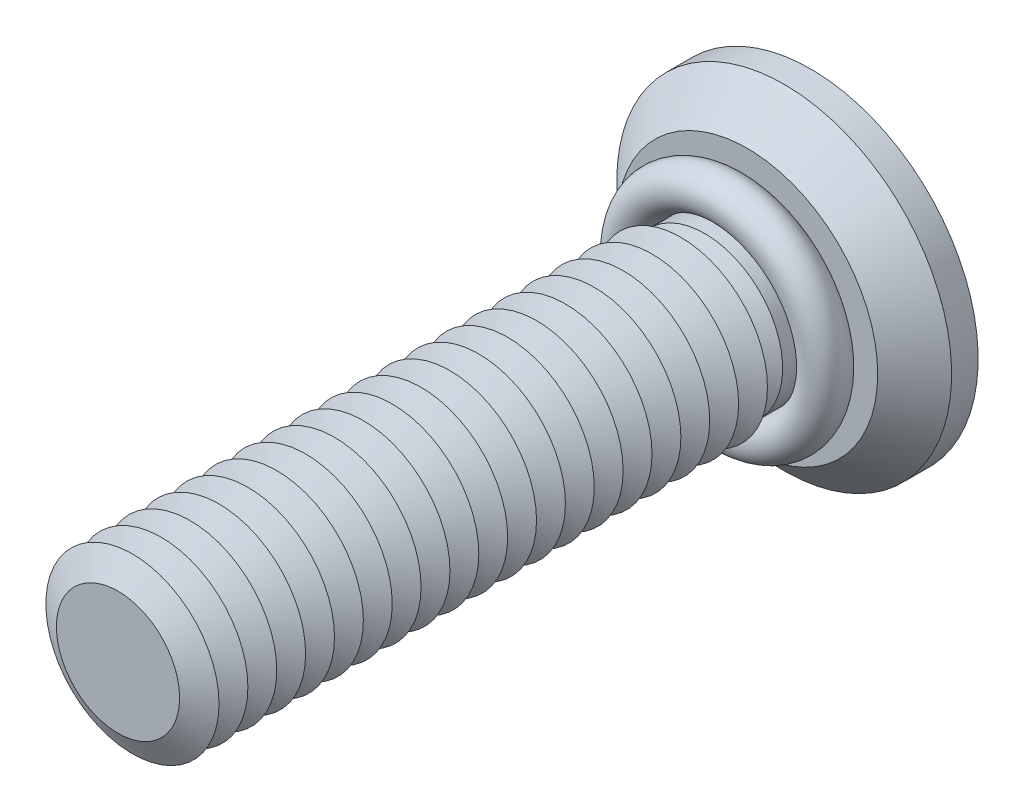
ISO-10303-21;
HEADER;
FILE_DESCRIPTION(('STEP AP214'),'2;1');
FILE_NAME('part.step','',(''),(''),'','','');
FILE_SCHEMA(('AUTOMOTIVE_DESIGN { 1 0 10303 214 1 1 1 1 }'));
ENDSEC;
DATA;
#1=APPLICATION_CONTEXT('core data for automotive mechanical design processes');
#2=APPLICATION_PROTOCOL_DEFINITION('international standard','automotive_design',2000,#1);
#3=PRODUCT_CONTEXT('',#1,'mechanical');
#4=PRODUCT('Part','Part','',(#3));
#5=PRODUCT_RELATED_PRODUCT_CATEGORY('part','',(#4));
#6=PRODUCT_DEFINITION_FORMATION('','',#4);
#7=PRODUCT_DEFINITION_CONTEXT('part definition',#1,'design');
#8=PRODUCT_DEFINITION('design','',#6,#7);
#9=PRODUCT_DEFINITION_SHAPE('','',#8);
#10=(LENGTH_UNIT() NAMED_UNIT(*) SI_UNIT(.MILLI.,.METRE.));
#11=(NAMED_UNIT(*) PLANE_ANGLE_UNIT() SI_UNIT($,.RADIAN.));
#12=(NAMED_UNIT(*) SI_UNIT($,.STERADIAN.) SOLID_ANGLE_UNIT());
#13=UNCERTAINTY_MEASURE_WITH_UNIT(LENGTH_MEASURE(1.E-05),#10,'distance_accuracy_value','');
#14=(GEOMETRIC_REPRESENTATION_CONTEXT(3) GLOBAL_UNCERTAINTY_ASSIGNED_CONTEXT((#13)) GLOBAL_UNIT_ASSIGNED_CONTEXT((#10,
#11,#12)) REPRESENTATION_CONTEXT('',''));
#15=CARTESIAN_POINT('',(0.,0.,0.));
#16=DIRECTION('',(0.,0.,1.));
#17=DIRECTION('',(1.,0.,0.));
#18=AXIS2_PLACEMENT_3D('',#15,#16,#17);
#19=CARTESIAN_POINT('',(0.,0.,1.45000000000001));
#20=DIRECTION('',(0.,0.,1.));
#21=DIRECTION('',(1.,0.,0.));
#22=AXIS2_PLACEMENT_3D('',#19,#20,#21);
#23=TOROIDAL_SURFACE('',#22,1.7,0.35);
#24=CARTESIAN_POINT('',(0.,1.7,1.45000000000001));
#25=DIRECTION('',(1.,0.,0.));
#26=DIRECTION('',(0.,0.,-1.));
#27=AXIS2_PLACEMENT_3D('',#24,#25,#26);
#28=CIRCLE('',#27,0.35);
#29=CARTESIAN_POINT('',(0.,2.05,1.45000000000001));
#30=VERTEX_POINT('',#29);
#31=EDGE_CURVE('P0_E10',#30,#30,#28,.T.);
#32=CARTESIAN_POINT('',(0.,0.,1.45000000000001));
#33=DIRECTION('',(0.,0.,1.));
#34=DIRECTION('',(1.,0.,0.));
#35=AXIS2_PLACEMENT_3D('',#32,#33,#34);
#36=CIRCLE('',#35,2.05);
#37=EDGE_CURVE('',#30,#30,#36,.T.);
#38=ORIENTED_EDGE('',*,*,#31,.F.);
#39=ORIENTED_EDGE('',*,*,#31,.T.);
#40=ORIENTED_EDGE('',*,*,#37,.T.);
#41=ORIENTED_EDGE('',*,*,#37,.F.);
#42=EDGE_LOOP('',(#38,#40,#39,#41));
#43=FACE_BOUND('',#42,.T.);
#44=ADVANCED_FACE('P0_F14',(#43),#23,.T.);
#45=CLOSED_SHELL('',(#44));
#46=MANIFOLD_SOLID_BREP('P0_B1',#45);
#47=CARTESIAN_POINT('',(0.,0.,9.5));
#48=DIRECTION('',(0.,0.,-1.));
#49=DIRECTION('',(-1.,0.,0.));
#50=AXIS2_PLACEMENT_3D('',#47,#48,#49);
#51=CONICAL_SURFACE('',#50,1.06698729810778,1.0471975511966);
#52=CARTESIAN_POINT('',(0.,0.,9.25));
#53=DIRECTION('',(0.,0.,1.));
#54=DIRECTION('',(1.,0.,0.));
#55=AXIS2_PLACEMENT_3D('',#52,#53,#54);
#56=CIRCLE('',#55,1.5);
#57=CARTESIAN_POINT('',(1.5,0.,9.25));
#58=VERTEX_POINT('',#57);
#59=EDGE_CURVE('P1_E324',#58,#58,#56,.T.);
#60=ORIENTED_EDGE('',*,*,#59,.T.);
#61=EDGE_LOOP('',(#60));
#62=FACE_BOUND('',#61,.T.);
#63=CARTESIAN_POINT('',(0.,0.,9.5));
#64=DIRECTION('',(0.,0.,1.));
#65=DIRECTION('',(1.,0.,0.));
#66=AXIS2_PLACEMENT_3D('',#63,#64,#65);
#67=CIRCLE('',#66,1.06698729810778);
#68=CARTESIAN_POINT('',(1.06698729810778,0.,9.5));
#69=VERTEX_POINT('',#68);
#70=EDGE_CURVE('P1_E321',#69,#69,#67,.T.);
#71=ORIENTED_EDGE('',*,*,#70,.F.);
#72=EDGE_LOOP('',(#71));
#73=FACE_BOUND('',#72,.T.);
#74=ADVANCED_FACE('P1_F15',(#62,#73),#51,.T.);
#75=CARTESIAN_POINT('',(0.,0.,9.75));
#76=DIRECTION('',(0.,0.,1.));
#77=DIRECTION('',(1.,0.,0.));
#78=AXIS2_PLACEMENT_3D('',#75,#76,#77);
#79=CONICAL_SURFACE('',#78,1.5,1.0471975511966);
#80=ORIENTED_EDGE('',*,*,#70,.T.);
#81=EDGE_LOOP('',(#80));
#82=FACE_BOUND('',#81,.T.);
#83=CARTESIAN_POINT('',(0.,0.,9.75));
#84=DIRECTION('',(0.,0.,1.));
#85=DIRECTION('',(1.,0.,0.));
#86=AXIS2_PLACEMENT_3D('',#83,#84,#85);
#87=CIRCLE('',#86,1.5);
#88=CARTESIAN_POINT('',(1.5,0.,9.75));
#89=VERTEX_POINT('',#88);
#90=EDGE_CURVE('P1_E318',#89,#89,#87,.T.);
#91=ORIENTED_EDGE('',*,*,#90,.F.);
#92=EDGE_LOOP('',(#91));
#93=FACE_BOUND('',#92,.T.);
#94=ADVANCED_FACE('P1_F245',(#82,#93),#79,.T.);
#95=CARTESIAN_POINT('',(0.,0.,12.));
#96=DIRECTION('',(0.,0.,1.));
#97=DIRECTION('',(1.,0.,0.));
#98=AXIS2_PLACEMENT_3D('',#95,#96,#97);
#99=PLANE('',#98);
#100=CARTESIAN_POINT('',(0.,0.,12.));
#101=DIRECTION('',(0.,0.,1.));
#102=DIRECTION('',(1.,0.,0.));
#103=AXIS2_PLACEMENT_3D('',#100,#101,#102);
#104=CIRCLE('',#103,1.06698729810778);
#105=CARTESIAN_POINT('',(1.06698729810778,0.,12.));
#106=VERTEX_POINT('',#105);
#107=EDGE_CURVE('P1_E131',#106,#106,#104,.T.);
#108=ORIENTED_EDGE('',*,*,#107,.T.);
#109=EDGE_LOOP('',(#108));
#110=FACE_BOUND('',#109,.T.);
#111=ADVANCED_FACE('P1_F251',(#110),#99,.T.);
#112=CARTESIAN_POINT('',(0.,0.,12.));
#113=DIRECTION('',(0.,0.,-1.));
#114=DIRECTION('',(-1.,0.,0.));
#115=AXIS2_PLACEMENT_3D('',#112,#113,#114);
#116=CONICAL_SURFACE('',#115,1.06698729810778,1.0471975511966);
#117=CARTESIAN_POINT('',(0.,0.,11.75));
#118=DIRECTION('',(0.,0.,1.));
#119=DIRECTION('',(1.,0.,0.));
#120=AXIS2_PLACEMENT_3D('',#117,#118,#119);
#121=CIRCLE('',#120,1.5);
#122=CARTESIAN_POINT('',(1.5,0.,11.75));
#123=VERTEX_POINT('',#122);
#124=EDGE_CURVE('P1_E133',#123,#123,#121,.T.);
#125=ORIENTED_EDGE('',*,*,#124,.T.);
#126=EDGE_LOOP('',(#125));
#127=FACE_BOUND('',#126,.T.);
#128=ORIENTED_EDGE('',*,*,#107,.F.);
#129=EDGE_LOOP('',(#128));
#130=FACE_BOUND('',#129,.T.);
#131=ADVANCED_FACE('P1_F196',(#127,#130),#116,.T.);
#132=CARTESIAN_POINT('',(0.,0.,11.75));
#133=DIRECTION('',(0.,0.,1.));
#134=DIRECTION('',(1.,0.,0.));
#135=AXIS2_PLACEMENT_3D('',#132,#133,#134);
#136=CONICAL_SURFACE('',#135,1.5,1.0471975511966);
#137=CARTESIAN_POINT('',(0.,0.,11.5));
#138=DIRECTION('',(0.,0.,1.));
#139=DIRECTION('',(1.,0.,0.));
#140=AXIS2_PLACEMENT_3D('',#137,#138,#139);
#141=CIRCLE('',#140,1.06698729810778);
#142=CARTESIAN_POINT('',(1.06698729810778,0.,11.5));
#143=VERTEX_POINT('',#142);
#144=EDGE_CURVE('P1_E297',#143,#143,#141,.T.);
#145=ORIENTED_EDGE('',*,*,#144,.T.);
#146=EDGE_LOOP('',(#145));
#147=FACE_BOUND('',#146,.T.);
#148=ORIENTED_EDGE('',*,*,#124,.F.);
#149=EDGE_LOOP('',(#148));
#150=FACE_BOUND('',#149,.T.);
#151=ADVANCED_FACE('P1_F284',(#147,#150),#136,.T.);
#152=CARTESIAN_POINT('',(0.,0.,11.5));
#153=DIRECTION('',(0.,0.,-1.));
#154=DIRECTION('',(-1.,0.,0.));
#155=AXIS2_PLACEMENT_3D('',#152,#153,#154);
#156=CONICAL_SURFACE('',#155,1.06698729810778,1.0471975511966);
#157=CARTESIAN_POINT('',(0.,0.,11.25));
#158=DIRECTION('',(0.,0.,1.));
#159=DIRECTION('',(1.,0.,0.));
#160=AXIS2_PLACEMENT_3D('',#157,#158,#159);
#161=CIRCLE('',#160,1.5);
#162=CARTESIAN_POINT('',(1.5,0.,11.25));
#163=VERTEX_POINT('',#162);
#164=EDGE_CURVE('P1_E294',#163,#163,#161,.T.);
#165=ORIENTED_EDGE('',*,*,#164,.T.);
#166=EDGE_LOOP('',(#165));
#167=FACE_BOUND('',#166,.T.);
#168=ORIENTED_EDGE('',*,*,#144,.F.);
#169=EDGE_LOOP('',(#168));
#170=FACE_BOUND('',#169,.T.);
#171=ADVANCED_FACE('P1_F279',(#167,#170),#156,.T.);
#172=CARTESIAN_POINT('',(0.,0.,11.25));
#173=DIRECTION('',(0.,0.,1.));
#174=DIRECTION('',(1.,0.,0.));
#175=AXIS2_PLACEMENT_3D('',#172,#173,#174);
#176=CONICAL_SURFACE('',#175,1.5,1.0471975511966);
#177=CARTESIAN_POINT('',(0.,0.,11.));
#178=DIRECTION('',(0.,0.,1.));
#179=DIRECTION('',(1.,0.,0.));
#180=AXIS2_PLACEMENT_3D('',#177,#178,#179);
#181=CIRCLE('',#180,1.06698729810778);
#182=CARTESIAN_POINT('',(1.06698729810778,0.,11.));
#183=VERTEX_POINT('',#182);
#184=EDGE_CURVE('P1_E301',#183,#183,#181,.T.);
#185=ORIENTED_EDGE('',*,*,#184,.T.);
#186=EDGE_LOOP('',(#185));
#187=FACE_BOUND('',#186,.T.);
#188=ORIENTED_EDGE('',*,*,#164,.F.);
#189=EDGE_LOOP('',(#188));
#190=FACE_BOUND('',#189,.T.);
#191=ADVANCED_FACE('P1_F276',(#187,#190),#176,.T.);
#192=CARTESIAN_POINT('',(0.,0.,11.));
#193=DIRECTION('',(0.,0.,-1.));
#194=DIRECTION('',(-1.,0.,0.));
#195=AXIS2_PLACEMENT_3D('',#192,#193,#194);
#196=CONICAL_SURFACE('',#195,1.06698729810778,1.0471975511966);
#197=CARTESIAN_POINT('',(0.,0.,10.75));
#198=DIRECTION('',(0.,0.,1.));
#199=DIRECTION('',(1.,0.,0.));
#200=AXIS2_PLACEMENT_3D('',#197,#198,#199);
#201=CIRCLE('',#200,1.5);
#202=CARTESIAN_POINT('',(1.5,0.,10.75));
#203=VERTEX_POINT('',#202);
#204=EDGE_CURVE('P1_E306',#203,#203,#201,.T.);
#205=ORIENTED_EDGE('',*,*,#204,.T.);
#206=EDGE_LOOP('',(#205));
#207=FACE_BOUND('',#206,.T.);
#208=ORIENTED_EDGE('',*,*,#184,.F.);
#209=EDGE_LOOP('',(#208));
#210=FACE_BOUND('',#209,.T.);
#211=ADVANCED_FACE('P1_F271',(#207,#210),#196,.T.);
#212=CARTESIAN_POINT('',(0.,0.,10.75));
#213=DIRECTION('',(0.,0.,1.));
#214=DIRECTION('',(1.,0.,0.));
#215=AXIS2_PLACEMENT_3D('',#212,#213,#214);
#216=CONICAL_SURFACE('',#215,1.5,1.0471975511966);
#217=CARTESIAN_POINT('',(0.,0.,10.5));
#218=DIRECTION('',(0.,0.,1.));
#219=DIRECTION('',(1.,0.,0.));
#220=AXIS2_PLACEMENT_3D('',#217,#218,#219);
#221=CIRCLE('',#220,1.06698729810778);
#222=CARTESIAN_POINT('',(1.06698729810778,0.,10.5));
#223=VERTEX_POINT('',#222);
#224=EDGE_CURVE('P1_E309',#223,#223,#221,.T.);
#225=ORIENTED_EDGE('',*,*,#224,.T.);
#226=EDGE_LOOP('',(#225));
#227=FACE_BOUND('',#226,.T.);
#228=ORIENTED_EDGE('',*,*,#204,.F.);
#229=EDGE_LOOP('',(#228));
#230=FACE_BOUND('',#229,.T.);
#231=ADVANCED_FACE('P1_F268',(#227,#230),#216,.T.);
#232=CARTESIAN_POINT('',(0.,0.,10.5));
#233=DIRECTION('',(0.,0.,-1.));
#234=DIRECTION('',(-1.,0.,0.));
#235=AXIS2_PLACEMENT_3D('',#232,#233,#234);
#236=CONICAL_SURFACE('',#235,1.06698729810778,1.0471975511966);
#237=CARTESIAN_POINT('',(0.,0.,10.25));
#238=DIRECTION('',(0.,0.,1.));
#239=DIRECTION('',(1.,0.,0.));
#240=AXIS2_PLACEMENT_3D('',#237,#238,#239);
#241=CIRCLE('',#240,1.5);
#242=CARTESIAN_POINT('',(1.5,0.,10.25));
#243=VERTEX_POINT('',#242);
#244=EDGE_CURVE('P1_E312',#243,#243,#241,.T.);
#245=ORIENTED_EDGE('',*,*,#244,.T.);
#246=EDGE_LOOP('',(#245));
#247=FACE_BOUND('',#246,.T.);
#248=ORIENTED_EDGE('',*,*,#224,.F.);
#249=EDGE_LOOP('',(#248));
#250=FACE_BOUND('',#249,.T.);
#251=ADVANCED_FACE('P1_F262',(#247,#250),#236,.T.);
#252=CARTESIAN_POINT('',(0.,0.,10.25));
#253=DIRECTION('',(0.,0.,1.));
#254=DIRECTION('',(1.,0.,0.));
#255=AXIS2_PLACEMENT_3D('',#252,#253,#254);
#256=CONICAL_SURFACE('',#255,1.5,1.0471975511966);
#257=CARTESIAN_POINT('',(0.,0.,10.));
#258=DIRECTION('',(0.,0.,1.));
#259=DIRECTION('',(1.,0.,0.));
#260=AXIS2_PLACEMENT_3D('',#257,#258,#259);
#261=CIRCLE('',#260,1.06698729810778);
#262=CARTESIAN_POINT('',(1.06698729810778,0.,10.));
#263=VERTEX_POINT('',#262);
#264=EDGE_CURVE('P1_E315',#263,#263,#261,.T.);
#265=ORIENTED_EDGE('',*,*,#264,.T.);
#266=EDGE_LOOP('',(#265));
#267=FACE_BOUND('',#266,.T.);
#268=ORIENTED_EDGE('',*,*,#244,.F.);
#269=EDGE_LOOP('',(#268));
#270=FACE_BOUND('',#269,.T.);
#271=ADVANCED_FACE('P1_F258',(#267,#270),#256,.T.);
#272=CARTESIAN_POINT('',(0.,0.,10.));
#273=DIRECTION('',(0.,0.,-1.));
#274=DIRECTION('',(-1.,0.,0.));
#275=AXIS2_PLACEMENT_3D('',#272,#273,#274);
#276=CONICAL_SURFACE('',#275,1.06698729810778,1.0471975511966);
#277=ORIENTED_EDGE('',*,*,#90,.T.);
#278=EDGE_LOOP('',(#277));
#279=FACE_BOUND('',#278,.T.);
#280=ORIENTED_EDGE('',*,*,#264,.F.);
#281=EDGE_LOOP('',(#280));
#282=FACE_BOUND('',#281,.T.);
#283=ADVANCED_FACE('P1_F261',(#279,#282),#276,.T.);
#284=CARTESIAN_POINT('',(0.,0.,9.));
#285=DIRECTION('',(0.,0.,-1.));
#286=DIRECTION('',(-1.,0.,0.));
#287=AXIS2_PLACEMENT_3D('',#284,#285,#286);
#288=CONICAL_SURFACE('',#287,1.06698729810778,1.0471975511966);
#289=CARTESIAN_POINT('',(0.,0.,8.75));
#290=DIRECTION('',(0.,0.,1.));
#291=DIRECTION('',(1.,0.,0.));
#292=AXIS2_PLACEMENT_3D('',#289,#290,#291);
#293=CIRCLE('',#292,1.5);
#294=CARTESIAN_POINT('',(1.5,0.,8.75));
#295=VERTEX_POINT('',#294);
#296=EDGE_CURVE('P1_E329',#295,#295,#293,.T.);
#297=ORIENTED_EDGE('',*,*,#296,.T.);
#298=EDGE_LOOP('',(#297));
#299=FACE_BOUND('',#298,.T.);
#300=CARTESIAN_POINT('',(0.,0.,9.));
#301=DIRECTION('',(0.,0.,1.));
#302=DIRECTION('',(1.,0.,0.));
#303=AXIS2_PLACEMENT_3D('',#300,#301,#302);
#304=CIRCLE('',#303,1.06698729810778);
#305=CARTESIAN_POINT('',(1.06698729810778,0.,9.));
#306=VERTEX_POINT('',#305);
#307=EDGE_CURVE('P1_E326',#306,#306,#304,.T.);
#308=ORIENTED_EDGE('',*,*,#307,.F.);
#309=EDGE_LOOP('',(#308));
#310=FACE_BOUND('',#309,.T.);
#311=ADVANCED_FACE('P1_F266',(#299,#310),#288,.T.);
#312=CARTESIAN_POINT('',(0.,0.,9.25));
#313=DIRECTION('',(0.,0.,1.));
#314=DIRECTION('',(1.,0.,0.));
#315=AXIS2_PLACEMENT_3D('',#312,#313,#314);
#316=CONICAL_SURFACE('',#315,1.5,1.0471975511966);
#317=ORIENTED_EDGE('',*,*,#307,.T.);
#318=EDGE_LOOP('',(#317));
#319=FACE_BOUND('',#318,.T.);
#320=ORIENTED_EDGE('',*,*,#59,.F.);
#321=EDGE_LOOP('',(#320));
#322=FACE_BOUND('',#321,.T.);
#323=ADVANCED_FACE('P1_F515',(#319,#322),#316,.T.);
#324=CARTESIAN_POINT('',(0.,0.,8.5));
#325=DIRECTION('',(0.,0.,-1.));
#326=DIRECTION('',(-1.,0.,0.));
#327=AXIS2_PLACEMENT_3D('',#324,#325,#326);
#328=CONICAL_SURFACE('',#327,1.06698729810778,1.0471975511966);
#329=CARTESIAN_POINT('',(0.,0.,8.25));
#330=DIRECTION('',(0.,0.,1.));
#331=DIRECTION('',(1.,0.,0.));
#332=AXIS2_PLACEMENT_3D('',#329,#330,#331);
#333=CIRCLE('',#332,1.5);
#334=CARTESIAN_POINT('',(1.5,0.,8.25));
#335=VERTEX_POINT('',#334);
#336=EDGE_CURVE('P1_E335',#335,#335,#333,.T.);
#337=ORIENTED_EDGE('',*,*,#336,.T.);
#338=EDGE_LOOP('',(#337));
#339=FACE_BOUND('',#338,.T.);
#340=CARTESIAN_POINT('',(0.,0.,8.5));
#341=DIRECTION('',(0.,0.,1.));
#342=DIRECTION('',(1.,0.,0.));
#343=AXIS2_PLACEMENT_3D('',#340,#341,#342);
#344=CIRCLE('',#343,1.06698729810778);
#345=CARTESIAN_POINT('',(1.06698729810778,0.,8.5));
#346=VERTEX_POINT('',#345);
#347=EDGE_CURVE('P1_E332',#346,#346,#344,.T.);
#348=ORIENTED_EDGE('',*,*,#347,.F.);
#349=EDGE_LOOP('',(#348));
#350=FACE_BOUND('',#349,.T.);
#351=ADVANCED_FACE('P1_F524',(#339,#350),#328,.T.);
#352=CARTESIAN_POINT('',(0.,0.,8.75));
#353=DIRECTION('',(0.,0.,1.));
#354=DIRECTION('',(1.,0.,0.));
#355=AXIS2_PLACEMENT_3D('',#352,#353,#354);
#356=CONICAL_SURFACE('',#355,1.5,1.0471975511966);
#357=ORIENTED_EDGE('',*,*,#347,.T.);
#358=EDGE_LOOP('',(#357));
#359=FACE_BOUND('',#358,.T.);
#360=ORIENTED_EDGE('',*,*,#296,.F.);
#361=EDGE_LOOP('',(#360));
#362=FACE_BOUND('',#361,.T.);
#363=ADVANCED_FACE('P1_F534',(#359,#362),#356,.T.);
#364=CARTESIAN_POINT('',(0.,0.,8.));
#365=DIRECTION('',(0.,0.,-1.));
#366=DIRECTION('',(-1.,0.,0.));
#367=AXIS2_PLACEMENT_3D('',#364,#365,#366);
#368=CONICAL_SURFACE('',#367,1.06698729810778,1.0471975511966);
#369=CARTESIAN_POINT('',(0.,0.,7.75));
#370=DIRECTION('',(0.,0.,1.));
#371=DIRECTION('',(1.,0.,0.));
#372=AXIS2_PLACEMENT_3D('',#369,#370,#371);
#373=CIRCLE('',#372,1.5);
#374=CARTESIAN_POINT('',(1.5,0.,7.75));
#375=VERTEX_POINT('',#374);
#376=EDGE_CURVE('P1_E341',#375,#375,#373,.T.);
#377=ORIENTED_EDGE('',*,*,#376,.T.);
#378=EDGE_LOOP('',(#377));
#379=FACE_BOUND('',#378,.T.);
#380=CARTESIAN_POINT('',(0.,0.,8.));
#381=DIRECTION('',(0.,0.,1.));
#382=DIRECTION('',(1.,0.,0.));
#383=AXIS2_PLACEMENT_3D('',#380,#381,#382);
#384=CIRCLE('',#383,1.06698729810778);
#385=CARTESIAN_POINT('',(1.06698729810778,0.,8.));
#386=VERTEX_POINT('',#385);
#387=EDGE_CURVE('P1_E338',#386,#386,#384,.T.);
#388=ORIENTED_EDGE('',*,*,#387,.F.);
#389=EDGE_LOOP('',(#388));
#390=FACE_BOUND('',#389,.T.);
#391=ADVANCED_FACE('P1_F544',(#379,#390),#368,.T.);
#392=CARTESIAN_POINT('',(0.,0.,8.25));
#393=DIRECTION('',(0.,0.,1.));
#394=DIRECTION('',(1.,0.,0.));
#395=AXIS2_PLACEMENT_3D('',#392,#393,#394);
#396=CONICAL_SURFACE('',#395,1.5,1.0471975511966);
#397=ORIENTED_EDGE('',*,*,#387,.T.);
#398=EDGE_LOOP('',(#397));
#399=FACE_BOUND('',#398,.T.);
#400=ORIENTED_EDGE('',*,*,#336,.F.);
#401=EDGE_LOOP('',(#400));
#402=FACE_BOUND('',#401,.T.);
#403=ADVANCED_FACE('P1_F554',(#399,#402),#396,.T.);
#404=CARTESIAN_POINT('',(0.,0.,7.5));
#405=DIRECTION('',(0.,0.,-1.));
#406=DIRECTION('',(-1.,0.,0.));
#407=AXIS2_PLACEMENT_3D('',#404,#405,#406);
#408=CONICAL_SURFACE('',#407,1.06698729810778,1.0471975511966);
#409=CARTESIAN_POINT('',(0.,0.,7.25));
#410=DIRECTION('',(0.,0.,1.));
#411=DIRECTION('',(1.,0.,0.));
#412=AXIS2_PLACEMENT_3D('',#409,#410,#411);
#413=CIRCLE('',#412,1.5);
#414=CARTESIAN_POINT('',(1.5,0.,7.25));
#415=VERTEX_POINT('',#414);
#416=EDGE_CURVE('P1_E347',#415,#415,#413,.T.);
#417=ORIENTED_EDGE('',*,*,#416,.T.);
#418=EDGE_LOOP('',(#417));
#419=FACE_BOUND('',#418,.T.);
#420=CARTESIAN_POINT('',(0.,0.,7.5));
#421=DIRECTION('',(0.,0.,1.));
#422=DIRECTION('',(1.,0.,0.));
#423=AXIS2_PLACEMENT_3D('',#420,#421,#422);
#424=CIRCLE('',#423,1.06698729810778);
#425=CARTESIAN_POINT('',(1.06698729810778,0.,7.5));
#426=VERTEX_POINT('',#425);
#427=EDGE_CURVE('P1_E344',#426,#426,#424,.T.);
#428=ORIENTED_EDGE('',*,*,#427,.F.);
#429=EDGE_LOOP('',(#428));
#430=FACE_BOUND('',#429,.T.);
#431=ADVANCED_FACE('P1_F564',(#419,#430),#408,.T.);
#432=CARTESIAN_POINT('',(0.,0.,7.75));
#433=DIRECTION('',(0.,0.,1.));
#434=DIRECTION('',(1.,0.,0.));
#435=AXIS2_PLACEMENT_3D('',#432,#433,#434);
#436=CONICAL_SURFACE('',#435,1.5,1.0471975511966);
#437=ORIENTED_EDGE('',*,*,#427,.T.);
#438=EDGE_LOOP('',(#437));
#439=FACE_BOUND('',#438,.T.);
#440=ORIENTED_EDGE('',*,*,#376,.F.);
#441=EDGE_LOOP('',(#440));
#442=FACE_BOUND('',#441,.T.);
#443=ADVANCED_FACE('P1_F574',(#439,#442),#436,.T.);
#444=CARTESIAN_POINT('',(0.,0.,7.));
#445=DIRECTION('',(0.,0.,-1.));
#446=DIRECTION('',(-1.,0.,0.));
#447=AXIS2_PLACEMENT_3D('',#444,#445,#446);
#448=CONICAL_SURFACE('',#447,1.06698729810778,1.0471975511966);
#449=CARTESIAN_POINT('',(0.,0.,6.75));
#450=DIRECTION('',(0.,0.,1.));
#451=DIRECTION('',(1.,0.,0.));
#452=AXIS2_PLACEMENT_3D('',#449,#450,#451);
#453=CIRCLE('',#452,1.5);
#454=CARTESIAN_POINT('',(1.5,0.,6.75));
#455=VERTEX_POINT('',#454);
#456=EDGE_CURVE('P1_E353',#455,#455,#453,.T.);
#457=ORIENTED_EDGE('',*,*,#456,.T.);
#458=EDGE_LOOP('',(#457));
#459=FACE_BOUND('',#458,.T.);
#460=CARTESIAN_POINT('',(0.,0.,7.));
#461=DIRECTION('',(0.,0.,1.));
#462=DIRECTION('',(1.,0.,0.));
#463=AXIS2_PLACEMENT_3D('',#460,#461,#462);
#464=CIRCLE('',#463,1.06698729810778);
#465=CARTESIAN_POINT('',(1.06698729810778,0.,7.));
#466=VERTEX_POINT('',#465);
#467=EDGE_CURVE('P1_E350',#466,#466,#464,.T.);
#468=ORIENTED_EDGE('',*,*,#467,.F.);
#469=EDGE_LOOP('',(#468));
#470=FACE_BOUND('',#469,.T.);
#471=ADVANCED_FACE('P1_F584',(#459,#470),#448,.T.);
#472=CARTESIAN_POINT('',(0.,0.,7.25));
#473=DIRECTION('',(0.,0.,1.));
#474=DIRECTION('',(1.,0.,0.));
#475=AXIS2_PLACEMENT_3D('',#472,#473,#474);
#476=CONICAL_SURFACE('',#475,1.5,1.0471975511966);
#477=ORIENTED_EDGE('',*,*,#467,.T.);
#478=EDGE_LOOP('',(#477));
#479=FACE_BOUND('',#478,.T.);
#480=ORIENTED_EDGE('',*,*,#416,.F.);
#481=EDGE_LOOP('',(#480));
#482=FACE_BOUND('',#481,.T.);
#483=ADVANCED_FACE('P1_F594',(#479,#482),#476,.T.);
#484=CARTESIAN_POINT('',(0.,0.,6.5));
#485=DIRECTION('',(0.,0.,-1.));
#486=DIRECTION('',(-1.,0.,0.));
#487=AXIS2_PLACEMENT_3D('',#484,#485,#486);
#488=CONICAL_SURFACE('',#487,1.06698729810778,1.0471975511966);
#489=CARTESIAN_POINT('',(0.,0.,6.25));
#490=DIRECTION('',(0.,0.,1.));
#491=DIRECTION('',(1.,0.,0.));
#492=AXIS2_PLACEMENT_3D('',#489,#490,#491);
#493=CIRCLE('',#492,1.5);
#494=CARTESIAN_POINT('',(1.5,0.,6.25));
#495=VERTEX_POINT('',#494);
#496=EDGE_CURVE('P1_E359',#495,#495,#493,.T.);
#497=ORIENTED_EDGE('',*,*,#496,.T.);
#498=EDGE_LOOP('',(#497));
#499=FACE_BOUND('',#498,.T.);
#500=CARTESIAN_POINT('',(0.,0.,6.5));
#501=DIRECTION('',(0.,0.,1.));
#502=DIRECTION('',(1.,0.,0.));
#503=AXIS2_PLACEMENT_3D('',#500,#501,#502);
#504=CIRCLE('',#503,1.06698729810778);
#505=CARTESIAN_POINT('',(1.06698729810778,0.,6.5));
#506=VERTEX_POINT('',#505);
#507=EDGE_CURVE('P1_E356',#506,#506,#504,.T.);
#508=ORIENTED_EDGE('',*,*,#507,.F.);
#509=EDGE_LOOP('',(#508));
#510=FACE_BOUND('',#509,.T.);
#511=ADVANCED_FACE('P1_F604',(#499,#510),#488,.T.);
#512=CARTESIAN_POINT('',(0.,0.,6.75));
#513=DIRECTION('',(0.,0.,1.));
#514=DIRECTION('',(1.,0.,0.));
#515=AXIS2_PLACEMENT_3D('',#512,#513,#514);
#516=CONICAL_SURFACE('',#515,1.5,1.0471975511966);
#517=ORIENTED_EDGE('',*,*,#507,.T.);
#518=EDGE_LOOP('',(#517));
#519=FACE_BOUND('',#518,.T.);
#520=ORIENTED_EDGE('',*,*,#456,.F.);
#521=EDGE_LOOP('',(#520));
#522=FACE_BOUND('',#521,.T.);
#523=ADVANCED_FACE('P1_F614',(#519,#522),#516,.T.);
#524=CARTESIAN_POINT('',(0.,0.,6.));
#525=DIRECTION('',(0.,0.,-1.));
#526=DIRECTION('',(-1.,0.,0.));
#527=AXIS2_PLACEMENT_3D('',#524,#525,#526);
#528=CONICAL_SURFACE('',#527,1.06698729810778,1.0471975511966);
#529=CARTESIAN_POINT('',(0.,0.,5.75));
#530=DIRECTION('',(0.,0.,1.));
#531=DIRECTION('',(1.,0.,0.));
#532=AXIS2_PLACEMENT_3D('',#529,#530,#531);
#533=CIRCLE('',#532,1.5);
#534=CARTESIAN_POINT('',(1.5,0.,5.75));
#535=VERTEX_POINT('',#534);
#536=EDGE_CURVE('P1_E365',#535,#535,#533,.T.);
#537=ORIENTED_EDGE('',*,*,#536,.T.);
#538=EDGE_LOOP('',(#537));
#539=FACE_BOUND('',#538,.T.);
#540=CARTESIAN_POINT('',(0.,0.,6.));
#541=DIRECTION('',(0.,0.,1.));
#542=DIRECTION('',(1.,0.,0.));
#543=AXIS2_PLACEMENT_3D('',#540,#541,#542);
#544=CIRCLE('',#543,1.06698729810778);
#545=CARTESIAN_POINT('',(1.06698729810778,0.,6.));
#546=VERTEX_POINT('',#545);
#547=EDGE_CURVE('P1_E362',#546,#546,#544,.T.);
#548=ORIENTED_EDGE('',*,*,#547,.F.);
#549=EDGE_LOOP('',(#548));
#550=FACE_BOUND('',#549,.T.);
#551=ADVANCED_FACE('P1_F624',(#539,#550),#528,.T.);
#552=CARTESIAN_POINT('',(0.,0.,6.25));
#553=DIRECTION('',(0.,0.,1.));
#554=DIRECTION('',(1.,0.,0.));
#555=AXIS2_PLACEMENT_3D('',#552,#553,#554);
#556=CONICAL_SURFACE('',#555,1.5,1.0471975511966);
#557=ORIENTED_EDGE('',*,*,#547,.T.);
#558=EDGE_LOOP('',(#557));
#559=FACE_BOUND('',#558,.T.);
#560=ORIENTED_EDGE('',*,*,#496,.F.);
#561=EDGE_LOOP('',(#560));
#562=FACE_BOUND('',#561,.T.);
#563=ADVANCED_FACE('P1_F634',(#559,#562),#556,.T.);
#564=CARTESIAN_POINT('',(0.,0.,5.5));
#565=DIRECTION('',(0.,0.,-1.));
#566=DIRECTION('',(-1.,0.,0.));
#567=AXIS2_PLACEMENT_3D('',#564,#565,#566);
#568=CONICAL_SURFACE('',#567,1.06698729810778,1.0471975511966);
#569=CARTESIAN_POINT('',(0.,0.,5.25));
#570=DIRECTION('',(0.,0.,1.));
#571=DIRECTION('',(1.,0.,0.));
#572=AXIS2_PLACEMENT_3D('',#569,#570,#571);
#573=CIRCLE('',#572,1.5);
#574=CARTESIAN_POINT('',(1.5,0.,5.25));
#575=VERTEX_POINT('',#574);
#576=EDGE_CURVE('P1_E371',#575,#575,#573,.T.);
#577=ORIENTED_EDGE('',*,*,#576,.T.);
#578=EDGE_LOOP('',(#577));
#579=FACE_BOUND('',#578,.T.);
#580=CARTESIAN_POINT('',(0.,0.,5.5));
#581=DIRECTION('',(0.,0.,1.));
#582=DIRECTION('',(1.,0.,0.));
#583=AXIS2_PLACEMENT_3D('',#580,#581,#582);
#584=CIRCLE('',#583,1.06698729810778);
#585=CARTESIAN_POINT('',(1.06698729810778,0.,5.5));
#586=VERTEX_POINT('',#585);
#587=EDGE_CURVE('P1_E368',#586,#586,#584,.T.);
#588=ORIENTED_EDGE('',*,*,#587,.F.);
#589=EDGE_LOOP('',(#588));
#590=FACE_BOUND('',#589,.T.);
#591=ADVANCED_FACE('P1_F644',(#579,#590),#568,.T.);
#592=CARTESIAN_POINT('',(0.,0.,5.75));
#593=DIRECTION('',(0.,0.,1.));
#594=DIRECTION('',(1.,0.,0.));
#595=AXIS2_PLACEMENT_3D('',#592,#593,#594);
#596=CONICAL_SURFACE('',#595,1.5,1.0471975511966);
#597=ORIENTED_EDGE('',*,*,#587,.T.);
#598=EDGE_LOOP('',(#597));
#599=FACE_BOUND('',#598,.T.);
#600=ORIENTED_EDGE('',*,*,#536,.F.);
#601=EDGE_LOOP('',(#600));
#602=FACE_BOUND('',#601,.T.);
#603=ADVANCED_FACE('P1_F654',(#599,#602),#596,.T.);
#604=CARTESIAN_POINT('',(0.,0.,5.));
#605=DIRECTION('',(0.,0.,-1.));
#606=DIRECTION('',(-1.,0.,0.));
#607=AXIS2_PLACEMENT_3D('',#604,#605,#606);
#608=CONICAL_SURFACE('',#607,1.06698729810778,1.0471975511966);
#609=CARTESIAN_POINT('',(0.,0.,4.75));
#610=DIRECTION('',(0.,0.,1.));
#611=DIRECTION('',(1.,0.,0.));
#612=AXIS2_PLACEMENT_3D('',#609,#610,#611);
#613=CIRCLE('',#612,1.5);
#614=CARTESIAN_POINT('',(1.5,0.,4.75));
#615=VERTEX_POINT('',#614);
#616=EDGE_CURVE('P1_E377',#615,#615,#613,.T.);
#617=ORIENTED_EDGE('',*,*,#616,.T.);
#618=EDGE_LOOP('',(#617));
#619=FACE_BOUND('',#618,.T.);
#620=CARTESIAN_POINT('',(0.,0.,5.));
#621=DIRECTION('',(0.,0.,1.));
#622=DIRECTION('',(1.,0.,0.));
#623=AXIS2_PLACEMENT_3D('',#620,#621,#622);
#624=CIRCLE('',#623,1.06698729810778);
#625=CARTESIAN_POINT('',(1.06698729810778,0.,5.));
#626=VERTEX_POINT('',#625);
#627=EDGE_CURVE('P1_E374',#626,#626,#624,.T.);
#628=ORIENTED_EDGE('',*,*,#627,.F.);
#629=EDGE_LOOP('',(#628));
#630=FACE_BOUND('',#629,.T.);
#631=ADVANCED_FACE('P1_F664',(#619,#630),#608,.T.);
#632=CARTESIAN_POINT('',(0.,0.,5.25));
#633=DIRECTION('',(0.,0.,1.));
#634=DIRECTION('',(1.,0.,0.));
#635=AXIS2_PLACEMENT_3D('',#632,#633,#634);
#636=CONICAL_SURFACE('',#635,1.5,1.0471975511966);
#637=ORIENTED_EDGE('',*,*,#627,.T.);
#638=EDGE_LOOP('',(#637));
#639=FACE_BOUND('',#638,.T.);
#640=ORIENTED_EDGE('',*,*,#576,.F.);
#641=EDGE_LOOP('',(#640));
#642=FACE_BOUND('',#641,.T.);
#643=ADVANCED_FACE('P1_F674',(#639,#642),#636,.T.);
#644=CARTESIAN_POINT('',(0.,0.,4.5));
#645=DIRECTION('',(0.,0.,-1.));
#646=DIRECTION('',(-1.,0.,0.));
#647=AXIS2_PLACEMENT_3D('',#644,#645,#646);
#648=CONICAL_SURFACE('',#647,1.06698729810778,1.0471975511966);
#649=CARTESIAN_POINT('',(0.,0.,4.25));
#650=DIRECTION('',(0.,0.,1.));
#651=DIRECTION('',(1.,0.,0.));
#652=AXIS2_PLACEMENT_3D('',#649,#650,#651);
#653=CIRCLE('',#652,1.5);
#654=CARTESIAN_POINT('',(1.5,0.,4.25));
#655=VERTEX_POINT('',#654);
#656=EDGE_CURVE('P1_E383',#655,#655,#653,.T.);
#657=ORIENTED_EDGE('',*,*,#656,.T.);
#658=EDGE_LOOP('',(#657));
#659=FACE_BOUND('',#658,.T.);
#660=CARTESIAN_POINT('',(0.,0.,4.5));
#661=DIRECTION('',(0.,0.,1.));
#662=DIRECTION('',(1.,0.,0.));
#663=AXIS2_PLACEMENT_3D('',#660,#661,#662);
#664=CIRCLE('',#663,1.06698729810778);
#665=CARTESIAN_POINT('',(1.06698729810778,0.,4.5));
#666=VERTEX_POINT('',#665);
#667=EDGE_CURVE('P1_E380',#666,#666,#664,.T.);
#668=ORIENTED_EDGE('',*,*,#667,.F.);
#669=EDGE_LOOP('',(#668));
#670=FACE_BOUND('',#669,.T.);
#671=ADVANCED_FACE('P1_F684',(#659,#670),#648,.T.);
#672=CARTESIAN_POINT('',(0.,0.,4.75));
#673=DIRECTION('',(0.,0.,1.));
#674=DIRECTION('',(1.,0.,0.));
#675=AXIS2_PLACEMENT_3D('',#672,#673,#674);
#676=CONICAL_SURFACE('',#675,1.5,1.0471975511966);
#677=ORIENTED_EDGE('',*,*,#667,.T.);
#678=EDGE_LOOP('',(#677));
#679=FACE_BOUND('',#678,.T.);
#680=ORIENTED_EDGE('',*,*,#616,.F.);
#681=EDGE_LOOP('',(#680));
#682=FACE_BOUND('',#681,.T.);
#683=ADVANCED_FACE('P1_F694',(#679,#682),#676,.T.);
#684=CARTESIAN_POINT('',(0.,0.,4.));
#685=DIRECTION('',(0.,0.,-1.));
#686=DIRECTION('',(-1.,0.,0.));
#687=AXIS2_PLACEMENT_3D('',#684,#685,#686);
#688=CONICAL_SURFACE('',#687,1.06698729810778,1.0471975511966);
#689=CARTESIAN_POINT('',(0.,0.,3.75));
#690=DIRECTION('',(0.,0.,1.));
#691=DIRECTION('',(1.,0.,0.));
#692=AXIS2_PLACEMENT_3D('',#689,#690,#691);
#693=CIRCLE('',#692,1.5);
#694=CARTESIAN_POINT('',(1.5,0.,3.75));
#695=VERTEX_POINT('',#694);
#696=EDGE_CURVE('P1_E389',#695,#695,#693,.T.);
#697=ORIENTED_EDGE('',*,*,#696,.T.);
#698=EDGE_LOOP('',(#697));
#699=FACE_BOUND('',#698,.T.);
#700=CARTESIAN_POINT('',(0.,0.,4.));
#701=DIRECTION('',(0.,0.,1.));
#702=DIRECTION('',(1.,0.,0.));
#703=AXIS2_PLACEMENT_3D('',#700,#701,#702);
#704=CIRCLE('',#703,1.06698729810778);
#705=CARTESIAN_POINT('',(1.06698729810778,0.,4.));
#706=VERTEX_POINT('',#705);
#707=EDGE_CURVE('P1_E386',#706,#706,#704,.T.);
#708=ORIENTED_EDGE('',*,*,#707,.F.);
#709=EDGE_LOOP('',(#708));
#710=FACE_BOUND('',#709,.T.);
#711=ADVANCED_FACE('P1_F704',(#699,#710),#688,.T.);
#712=CARTESIAN_POINT('',(0.,0.,4.25));
#713=DIRECTION('',(0.,0.,1.));
#714=DIRECTION('',(1.,0.,0.));
#715=AXIS2_PLACEMENT_3D('',#712,#713,#714);
#716=CONICAL_SURFACE('',#715,1.5,1.0471975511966);
#717=ORIENTED_EDGE('',*,*,#707,.T.);
#718=EDGE_LOOP('',(#717));
#719=FACE_BOUND('',#718,.T.);
#720=ORIENTED_EDGE('',*,*,#656,.F.);
#721=EDGE_LOOP('',(#720));
#722=FACE_BOUND('',#721,.T.);
#723=ADVANCED_FACE('P1_F714',(#719,#722),#716,.T.);
#724=CARTESIAN_POINT('',(0.,0.,3.5));
#725=DIRECTION('',(0.,0.,-1.));
#726=DIRECTION('',(-1.,0.,0.));
#727=AXIS2_PLACEMENT_3D('',#724,#725,#726);
#728=CONICAL_SURFACE('',#727,1.06698729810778,1.0471975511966);
#729=CARTESIAN_POINT('',(0.,0.,3.25));
#730=DIRECTION('',(0.,0.,1.));
#731=DIRECTION('',(1.,0.,0.));
#732=AXIS2_PLACEMENT_3D('',#729,#730,#731);
#733=CIRCLE('',#732,1.5);
#734=CARTESIAN_POINT('',(1.5,0.,3.25));
#735=VERTEX_POINT('',#734);
#736=EDGE_CURVE('P1_E395',#735,#735,#733,.T.);
#737=ORIENTED_EDGE('',*,*,#736,.T.);
#738=EDGE_LOOP('',(#737));
#739=FACE_BOUND('',#738,.T.);
#740=CARTESIAN_POINT('',(0.,0.,3.5));
#741=DIRECTION('',(0.,0.,1.));
#742=DIRECTION('',(1.,0.,0.));
#743=AXIS2_PLACEMENT_3D('',#740,#741,#742);
#744=CIRCLE('',#743,1.06698729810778);
#745=CARTESIAN_POINT('',(1.06698729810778,0.,3.5));
#746=VERTEX_POINT('',#745);
#747=EDGE_CURVE('P1_E392',#746,#746,#744,.T.);
#748=ORIENTED_EDGE('',*,*,#747,.F.);
#749=EDGE_LOOP('',(#748));
#750=FACE_BOUND('',#749,.T.);
#751=ADVANCED_FACE('P1_F724',(#739,#750),#728,.T.);
#752=CARTESIAN_POINT('',(0.,0.,3.75));
#753=DIRECTION('',(0.,0.,1.));
#754=DIRECTION('',(1.,0.,0.));
#755=AXIS2_PLACEMENT_3D('',#752,#753,#754);
#756=CONICAL_SURFACE('',#755,1.5,1.0471975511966);
#757=ORIENTED_EDGE('',*,*,#747,.T.);
#758=EDGE_LOOP('',(#757));
#759=FACE_BOUND('',#758,.T.);
#760=ORIENTED_EDGE('',*,*,#696,.F.);
#761=EDGE_LOOP('',(#760));
#762=FACE_BOUND('',#761,.T.);
#763=ADVANCED_FACE('P1_F734',(#759,#762),#756,.T.);
#764=CARTESIAN_POINT('',(0.,0.,3.));
#765=DIRECTION('',(0.,0.,-1.));
#766=DIRECTION('',(-1.,0.,0.));
#767=AXIS2_PLACEMENT_3D('',#764,#765,#766);
#768=CONICAL_SURFACE('',#767,1.06698729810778,1.0471975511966);
#769=CARTESIAN_POINT('',(0.,0.,2.75));
#770=DIRECTION('',(0.,0.,1.));
#771=DIRECTION('',(1.,0.,0.));
#772=AXIS2_PLACEMENT_3D('',#769,#770,#771);
#773=CIRCLE('',#772,1.5);
#774=CARTESIAN_POINT('',(1.5,0.,2.75));
#775=VERTEX_POINT('',#774);
#776=EDGE_CURVE('P1_E401',#775,#775,#773,.T.);
#777=ORIENTED_EDGE('',*,*,#776,.T.);
#778=EDGE_LOOP('',(#777));
#779=FACE_BOUND('',#778,.T.);
#780=CARTESIAN_POINT('',(0.,0.,3.));
#781=DIRECTION('',(0.,0.,1.));
#782=DIRECTION('',(1.,0.,0.));
#783=AXIS2_PLACEMENT_3D('',#780,#781,#782);
#784=CIRCLE('',#783,1.06698729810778);
#785=CARTESIAN_POINT('',(1.06698729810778,0.,3.));
#786=VERTEX_POINT('',#785);
#787=EDGE_CURVE('P1_E398',#786,#786,#784,.T.);
#788=ORIENTED_EDGE('',*,*,#787,.F.);
#789=EDGE_LOOP('',(#788));
#790=FACE_BOUND('',#789,.T.);
#791=ADVANCED_FACE('P1_F744',(#779,#790),#768,.T.);
#792=CARTESIAN_POINT('',(0.,0.,3.25));
#793=DIRECTION('',(0.,0.,1.));
#794=DIRECTION('',(1.,0.,0.));
#795=AXIS2_PLACEMENT_3D('',#792,#793,#794);
#796=CONICAL_SURFACE('',#795,1.5,1.0471975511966);
#797=ORIENTED_EDGE('',*,*,#787,.T.);
#798=EDGE_LOOP('',(#797));
#799=FACE_BOUND('',#798,.T.);
#800=ORIENTED_EDGE('',*,*,#736,.F.);
#801=EDGE_LOOP('',(#800));
#802=FACE_BOUND('',#801,.T.);
#803=ADVANCED_FACE('P1_F754',(#799,#802),#796,.T.);
#804=CARTESIAN_POINT('',(0.,0.,2.5));
#805=DIRECTION('',(0.,0.,-1.));
#806=DIRECTION('',(-1.,0.,0.));
#807=AXIS2_PLACEMENT_3D('',#804,#805,#806);
#808=CONICAL_SURFACE('',#807,1.06698729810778,1.0471975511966);
#809=CARTESIAN_POINT('',(0.,0.,2.25));
#810=DIRECTION('',(0.,0.,1.));
#811=DIRECTION('',(1.,0.,0.));
#812=AXIS2_PLACEMENT_3D('',#809,#810,#811);
#813=CIRCLE('',#812,1.5);
#814=CARTESIAN_POINT('',(1.5,0.,2.25));
#815=VERTEX_POINT('',#814);
#816=EDGE_CURVE('P1_E407',#815,#815,#813,.T.);
#817=ORIENTED_EDGE('',*,*,#816,.T.);
#818=EDGE_LOOP('',(#817));
#819=FACE_BOUND('',#818,.T.);
#820=CARTESIAN_POINT('',(0.,0.,2.5));
#821=DIRECTION('',(0.,0.,1.));
#822=DIRECTION('',(1.,0.,0.));
#823=AXIS2_PLACEMENT_3D('',#820,#821,#822);
#824=CIRCLE('',#823,1.06698729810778);
#825=CARTESIAN_POINT('',(1.06698729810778,0.,2.5));
#826=VERTEX_POINT('',#825);
#827=EDGE_CURVE('P1_E404',#826,#826,#824,.T.);
#828=ORIENTED_EDGE('',*,*,#827,.F.);
#829=EDGE_LOOP('',(#828));
#830=FACE_BOUND('',#829,.T.);
#831=ADVANCED_FACE('P1_F764',(#819,#830),#808,.T.);
#832=CARTESIAN_POINT('',(0.,0.,2.75));
#833=DIRECTION('',(0.,0.,1.));
#834=DIRECTION('',(1.,0.,0.));
#835=AXIS2_PLACEMENT_3D('',#832,#833,#834);
#836=CONICAL_SURFACE('',#835,1.5,1.0471975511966);
#837=ORIENTED_EDGE('',*,*,#827,.T.);
#838=EDGE_LOOP('',(#837));
#839=FACE_BOUND('',#838,.T.);
#840=ORIENTED_EDGE('',*,*,#776,.F.);
#841=EDGE_LOOP('',(#840));
#842=FACE_BOUND('',#841,.T.);
#843=ADVANCED_FACE('P1_F420',(#839,#842),#836,.T.);
#844=CARTESIAN_POINT('',(0.,0.,2.));
#845=DIRECTION('',(0.,0.,-1.));
#846=DIRECTION('',(-1.,0.,0.));
#847=AXIS2_PLACEMENT_3D('',#844,#845,#846);
#848=CONICAL_SURFACE('',#847,1.06698729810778,1.0471975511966);
#849=CARTESIAN_POINT('',(0.,0.,2.));
#850=DIRECTION('',(0.,0.,1.));
#851=DIRECTION('',(1.,0.,0.));
#852=AXIS2_PLACEMENT_3D('',#849,#850,#851);
#853=CIRCLE('',#852,1.06698729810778);
#854=CARTESIAN_POINT('',(1.06698729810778,0.,2.));
#855=VERTEX_POINT('',#854);
#856=EDGE_CURVE('P1_E410',#855,#855,#853,.T.);
#857=ORIENTED_EDGE('',*,*,#856,.F.);
#858=EDGE_LOOP('',(#857));
#859=FACE_BOUND('',#858,.T.);
#860=CARTESIAN_POINT('',(0.,0.,1.83660254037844));
#861=DIRECTION('',(0.,0.,-1.));
#862=DIRECTION('',(-1.,0.,0.));
#863=AXIS2_PLACEMENT_3D('',#860,#861,#862);
#864=CIRCLE('',#863,1.35);
#865=CARTESIAN_POINT('',(-1.35,0.,1.83660254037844));
#866=VERTEX_POINT('',#865);
#867=EDGE_CURVE('P1_E19',#866,#866,#864,.F.);
#868=ORIENTED_EDGE('',*,*,#867,.T.);
#869=EDGE_LOOP('',(#868));
#870=FACE_BOUND('',#869,.T.);
#871=ADVANCED_FACE('P1_F417',(#859,#870),#848,.T.);
#872=CARTESIAN_POINT('',(0.,0.,2.25));
#873=DIRECTION('',(0.,0.,1.));
#874=DIRECTION('',(1.,0.,0.));
#875=AXIS2_PLACEMENT_3D('',#872,#873,#874);
#876=CONICAL_SURFACE('',#875,1.5,1.0471975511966);
#877=ORIENTED_EDGE('',*,*,#856,.T.);
#878=EDGE_LOOP('',(#877));
#879=FACE_BOUND('',#878,.T.);
#880=ORIENTED_EDGE('',*,*,#816,.F.);
#881=EDGE_LOOP('',(#880));
#882=FACE_BOUND('',#881,.T.);
#883=ADVANCED_FACE('P1_F414',(#879,#882),#876,.T.);
#884=CARTESIAN_POINT('',(0.,0.,1.2));
#885=DIRECTION('',(0.,0.,-1.));
#886=DIRECTION('',(-1.,0.,0.));
#887=AXIS2_PLACEMENT_3D('',#884,#885,#886);
#888=CONICAL_SURFACE('',#887,1.,1.0471975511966);
#889=CARTESIAN_POINT('',(0.,0.,1.77735026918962));
#890=VERTEX_POINT('',#889);
#891=VERTEX_LOOP('',#890);
#892=FACE_BOUND('',#891,.T.);
#893=CARTESIAN_POINT('',(0.,0.,1.2));
#894=DIRECTION('',(0.,0.,-1.));
#895=DIRECTION('',(-1.,0.,0.));
#896=AXIS2_PLACEMENT_3D('',#893,#894,#895);
#897=CIRCLE('',#896,1.);
#898=CARTESIAN_POINT('',(-1.,0.,1.2));
#899=VERTEX_POINT('',#898);
#900=CARTESIAN_POINT('',(-0.5,0.866025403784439,1.2));
#901=VERTEX_POINT('',#900);
#902=EDGE_CURVE('P1_E117',#899,#901,#897,.T.);
#903=ORIENTED_EDGE('',*,*,#902,.T.);
#904=CARTESIAN_POINT('',(0.,0.,1.2));
#905=DIRECTION('',(0.,0.,-1.));
#906=DIRECTION('',(-1.,0.,0.));
#907=AXIS2_PLACEMENT_3D('',#904,#905,#906);
#908=CIRCLE('',#907,1.);
#909=CARTESIAN_POINT('',(0.5,0.866025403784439,1.2));
#910=VERTEX_POINT('',#909);
#911=EDGE_CURVE('P1_E24',#901,#910,#908,.T.);
#912=ORIENTED_EDGE('',*,*,#911,.T.);
#913=CARTESIAN_POINT('',(1.,0.,1.2));
#914=VERTEX_POINT('',#913);
#915=EDGE_CURVE('P1_E999',#910,#914,#908,.T.);
#916=ORIENTED_EDGE('',*,*,#915,.T.);
#917=CARTESIAN_POINT('',(0.5,-0.866025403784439,1.2));
#918=VERTEX_POINT('',#917);
#919=EDGE_CURVE('P1_E992',#914,#918,#908,.T.);
#920=ORIENTED_EDGE('',*,*,#919,.T.);
#921=CARTESIAN_POINT('',(-0.499999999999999,-0.866025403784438,1.2));
#922=VERTEX_POINT('',#921);
#923=EDGE_CURVE('P1_E182',#918,#922,#908,.T.);
#924=ORIENTED_EDGE('',*,*,#923,.T.);
#925=EDGE_CURVE('P1_E179',#922,#899,#908,.T.);
#926=ORIENTED_EDGE('',*,*,#925,.T.);
#927=EDGE_LOOP('',(#903,#912,#916,#920,#924,#926));
#928=FACE_BOUND('',#927,.T.);
#929=ADVANCED_FACE('P1_F198',(#892,#928),#888,.F.);
#930=CARTESIAN_POINT('',(0.,0.,1.2));
#931=DIRECTION('',(0.,0.,-1.));
#932=DIRECTION('',(-1.,0.,0.));
#933=AXIS2_PLACEMENT_3D('',#930,#931,#932);
#934=PLANE('',#933);
#935=ORIENTED_EDGE('',*,*,#923,.F.);
#936=DIRECTION('',(-0.866025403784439,-0.5,0.));
#937=VECTOR('',#936,1.);
#938=CARTESIAN_POINT('',(1.,-0.577350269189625,1.2));
#939=LINE('',#938,#937);
#940=CARTESIAN_POINT('',(0.,-1.15470053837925,1.2));
#941=VERTEX_POINT('',#940);
#942=EDGE_CURVE('P1_E1008',#918,#941,#939,.T.);
#943=ORIENTED_EDGE('',*,*,#942,.T.);
#944=DIRECTION('',(-0.866025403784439,0.5,0.));
#945=VECTOR('',#944,1.);
#946=CARTESIAN_POINT('',(0.,-1.15470053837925,1.2));
#947=LINE('',#946,#945);
#948=EDGE_CURVE('P1_E1015',#941,#922,#947,.T.);
#949=ORIENTED_EDGE('',*,*,#948,.T.);
#950=EDGE_LOOP('',(#935,#943,#949));
#951=FACE_BOUND('',#950,.T.);
#952=ADVANCED_FACE('P1_F806',(#951),#934,.T.);
#953=ORIENTED_EDGE('',*,*,#925,.F.);
#954=CARTESIAN_POINT('',(-1.,-0.577350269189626,1.2));
#955=VERTEX_POINT('',#954);
#956=EDGE_CURVE('P1_E1018',#922,#955,#947,.T.);
#957=ORIENTED_EDGE('',*,*,#956,.T.);
#958=DIRECTION('',(0.,1.,0.));
#959=VECTOR('',#958,1.);
#960=CARTESIAN_POINT('',(-1.,-0.577350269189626,1.2));
#961=LINE('',#960,#959);
#962=EDGE_CURVE('P1_E123',#955,#899,#961,.T.);
#963=ORIENTED_EDGE('',*,*,#962,.T.);
#964=EDGE_LOOP('',(#953,#957,#963));
#965=FACE_BOUND('',#964,.T.);
#966=ADVANCED_FACE('P1_F231',(#965),#934,.T.);
#967=ORIENTED_EDGE('',*,*,#902,.F.);
#968=CARTESIAN_POINT('',(-0.999999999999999,0.577350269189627,1.2));
#969=VERTEX_POINT('',#968);
#970=EDGE_CURVE('P1_E1020',#899,#969,#961,.T.);
#971=ORIENTED_EDGE('',*,*,#970,.T.);
#972=DIRECTION('',(0.866025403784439,0.5,0.));
#973=VECTOR('',#972,1.);
#974=CARTESIAN_POINT('',(-0.999999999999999,0.577350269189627,1.2));
#975=LINE('',#974,#973);
#976=EDGE_CURVE('P1_E1023',#969,#901,#975,.T.);
#977=ORIENTED_EDGE('',*,*,#976,.T.);
#978=EDGE_LOOP('',(#967,#971,#977));
#979=FACE_BOUND('',#978,.T.);
#980=ADVANCED_FACE('P1_F823',(#979),#934,.T.);
#981=ORIENTED_EDGE('',*,*,#911,.F.);
#982=CARTESIAN_POINT('',(0.,1.15470053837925,1.2));
#983=VERTEX_POINT('',#982);
#984=EDGE_CURVE('P1_E1022',#901,#983,#975,.T.);
#985=ORIENTED_EDGE('',*,*,#984,.T.);
#986=DIRECTION('',(0.866025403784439,-0.5,0.));
#987=VECTOR('',#986,1.);
#988=CARTESIAN_POINT('',(0.,1.15470053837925,1.2));
#989=LINE('',#988,#987);
#990=EDGE_CURVE('P1_E161',#983,#910,#989,.T.);
#991=ORIENTED_EDGE('',*,*,#990,.T.);
#992=EDGE_LOOP('',(#981,#985,#991));
#993=FACE_BOUND('',#992,.T.);
#994=ADVANCED_FACE('P1_F832',(#993),#934,.T.);
#995=ORIENTED_EDGE('',*,*,#915,.F.);
#996=CARTESIAN_POINT('',(1.,0.577350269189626,1.2));
#997=VERTEX_POINT('',#996);
#998=EDGE_CURVE('P1_E1007',#910,#997,#989,.T.);
#999=ORIENTED_EDGE('',*,*,#998,.T.);
#1000=DIRECTION('',(0.,-1.,0.));
#1001=VECTOR('',#1000,1.);
#1002=CARTESIAN_POINT('',(1.,0.577350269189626,1.2));
#1003=LINE('',#1002,#1001);
#1004=EDGE_CURVE('P1_E1002',#997,#914,#1003,.T.);
#1005=ORIENTED_EDGE('',*,*,#1004,.T.);
#1006=EDGE_LOOP('',(#995,#999,#1005));
#1007=FACE_BOUND('',#1006,.T.);
#1008=ADVANCED_FACE('P1_F841',(#1007),#934,.T.);
#1009=ORIENTED_EDGE('',*,*,#919,.F.);
#1010=CARTESIAN_POINT('',(1.,-0.577350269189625,1.2));
#1011=VERTEX_POINT('',#1010);
#1012=EDGE_CURVE('P1_E994',#914,#1011,#1003,.T.);
#1013=ORIENTED_EDGE('',*,*,#1012,.T.);
#1014=EDGE_CURVE('P1_E125',#1011,#918,#939,.T.);
#1015=ORIENTED_EDGE('',*,*,#1014,.T.);
#1016=EDGE_LOOP('',(#1009,#1013,#1015));
#1017=FACE_BOUND('',#1016,.T.);
#1018=ADVANCED_FACE('P1_F229',(#1017),#934,.T.);
#1019=CARTESIAN_POINT('',(1.,-0.577350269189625,1.2));
#1020=DIRECTION('',(0.5,-0.866025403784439,0.));
#1021=DIRECTION('',(0.866025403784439,0.5,0.));
#1022=AXIS2_PLACEMENT_3D('',#1019,#1020,#1021);
#1023=PLANE('',#1022);
#1024=DIRECTION('',(0.,0.,-1.));
#1025=VECTOR('',#1024,1.);
#1026=CARTESIAN_POINT('',(1.,-0.577350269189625,1.2));
#1027=LINE('',#1026,#1025);
#1028=CARTESIAN_POINT('',(1.,-0.577350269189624,0.));
#1029=VERTEX_POINT('',#1028);
#1030=EDGE_CURVE('P1_E164',#1011,#1029,#1027,.T.);
#1031=ORIENTED_EDGE('',*,*,#1030,.T.);
#1032=CARTESIAN_POINT('',(1.0002,-0.577234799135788,-3.09447482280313E-05));
#1033=CARTESIAN_POINT('',(0.958655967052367,-0.601220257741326,0.00640029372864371));
#1034=CARTESIAN_POINT('',(0.917036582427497,-0.625249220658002,0.0122389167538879));
#1035=CARTESIAN_POINT('',(0.833650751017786,-0.673392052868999,0.022496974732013));
#1036=CARTESIAN_POINT('',(0.79188425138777,-0.697505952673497,0.0269158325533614));
#1037=CARTESIAN_POINT('',(0.70845756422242,-0.745672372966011,0.0340762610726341));
#1038=CARTESIAN_POINT('',(0.666797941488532,-0.769724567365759,0.036826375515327));
#1039=CARTESIAN_POINT('',(0.583425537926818,-0.817859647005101,0.0405140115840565));
#1040=CARTESIAN_POINT('',(0.541712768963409,-0.84194252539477,0.0414518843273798));
#1041=CARTESIAN_POINT('',(0.458287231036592,-0.890108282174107,0.0414518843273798));
#1042=CARTESIAN_POINT('',(0.416574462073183,-0.914191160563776,0.0405140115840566));
#1043=CARTESIAN_POINT('',(0.333202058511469,-0.962326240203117,0.0368263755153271));
#1044=CARTESIAN_POINT('',(0.291542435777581,-0.986378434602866,0.0340762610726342));
#1045=CARTESIAN_POINT('',(0.208115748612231,-1.03454485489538,0.0269158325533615));
#1046=CARTESIAN_POINT('',(0.166349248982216,-1.05865875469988,0.0224969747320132));
#1047=CARTESIAN_POINT('',(0.0829634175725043,-1.10680158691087,0.012238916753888));
#1048=CARTESIAN_POINT('',(0.0413440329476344,-1.13083054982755,0.00640029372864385));
#1049=CARTESIAN_POINT('',(-0.000199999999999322,-1.15481600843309,-3.09447482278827E-05));
#1050=B_SPLINE_CURVE_WITH_KNOTS('',3,(#1032,#1033,#1034,#1035,#1036,#1037,#1038,#1039,#1040,
#1041,#1042,#1043,#1044,#1045,#1046,#1047,#1048,#1049),.UNSPECIFIED.,.F.,.F.,(4,2,2,2,2,2,2,2,
4),(0.,0.145207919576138,0.290474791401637,0.434991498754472,0.579480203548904,
0.723968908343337,0.868485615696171,1.01375248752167,1.15896040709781),.UNSPECIFIED.);
#1051=CARTESIAN_POINT('',(0.,-1.15470053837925,0.));
#1052=VERTEX_POINT('',#1051);
#1053=EDGE_CURVE('P1_E118',#1029,#1052,#1050,.T.);
#1054=ORIENTED_EDGE('',*,*,#1053,.T.);
#1055=DIRECTION('',(0.,0.,-1.));
#1056=VECTOR('',#1055,1.);
#1057=CARTESIAN_POINT('',(0.,-1.15470053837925,1.2));
#1058=LINE('',#1057,#1056);
#1059=EDGE_CURVE('P1_E116',#941,#1052,#1058,.T.);
#1060=ORIENTED_EDGE('',*,*,#1059,.F.);
#1061=ORIENTED_EDGE('',*,*,#942,.F.);
#1062=ORIENTED_EDGE('',*,*,#1014,.F.);
#1063=EDGE_LOOP('',(#1031,#1054,#1060,#1061,#1062));
#1064=FACE_BOUND('',#1063,.T.);
#1065=ADVANCED_FACE('P1_F226',(#1064),#1023,.F.);
#1066=CARTESIAN_POINT('',(0.,-1.15470053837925,1.2));
#1067=DIRECTION('',(-0.5,-0.866025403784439,0.));
#1068=DIRECTION('',(0.866025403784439,-0.5,0.));
#1069=AXIS2_PLACEMENT_3D('',#1066,#1067,#1068);
#1070=PLANE('',#1069);
#1071=ORIENTED_EDGE('',*,*,#1059,.T.);
#1072=CARTESIAN_POINT('',(0.000200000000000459,-1.15481600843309,-3.09447482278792E-05));
#1073=CARTESIAN_POINT('',(-0.0413440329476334,-1.13083054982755,0.00640029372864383));
#1074=CARTESIAN_POINT('',(-0.0829634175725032,-1.10680158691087,0.012238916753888));
#1075=CARTESIAN_POINT('',(-0.166349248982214,-1.05865875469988,0.0224969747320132));
#1076=CARTESIAN_POINT('',(-0.20811574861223,-1.03454485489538,0.0269158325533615));
#1077=CARTESIAN_POINT('',(-0.29154243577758,-0.986378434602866,0.0340762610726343));
#1078=CARTESIAN_POINT('',(-0.333202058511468,-0.962326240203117,0.0368263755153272));
#1079=CARTESIAN_POINT('',(-0.416574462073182,-0.914191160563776,0.0405140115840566));
#1080=CARTESIAN_POINT('',(-0.458287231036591,-0.890108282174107,0.0414518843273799));
#1081=CARTESIAN_POINT('',(-0.541712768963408,-0.84194252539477,0.0414518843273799));
#1082=CARTESIAN_POINT('',(-0.583425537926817,-0.817859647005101,0.0405140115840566));
#1083=CARTESIAN_POINT('',(-0.666797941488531,-0.76972456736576,0.0368263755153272));
#1084=CARTESIAN_POINT('',(-0.708457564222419,-0.745672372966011,0.0340762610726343));
#1085=CARTESIAN_POINT('',(-0.791884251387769,-0.697505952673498,0.0269158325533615));
#1086=CARTESIAN_POINT('',(-0.833650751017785,-0.673392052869,0.0224969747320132));
#1087=CARTESIAN_POINT('',(-0.917036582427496,-0.625249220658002,0.012238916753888));
#1088=CARTESIAN_POINT('',(-0.958655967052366,-0.601220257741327,0.00640029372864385));
#1089=CARTESIAN_POINT('',(-1.0002,-0.577234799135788,-3.09447482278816E-05));
#1090=B_SPLINE_CURVE_WITH_KNOTS('',3,(#1072,#1073,#1074,#1075,#1076,#1077,#1078,#1079,#1080,
#1081,#1082,#1083,#1084,#1085,#1086,#1087,#1088,#1089),.UNSPECIFIED.,.F.,.F.,(4,2,2,2,2,2,2,2,
4),(0.,0.145207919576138,0.290474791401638,0.434991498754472,0.579480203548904,
0.723968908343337,0.868485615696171,1.01375248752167,1.15896040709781),.UNSPECIFIED.);
#1091=CARTESIAN_POINT('',(-1.,-0.577350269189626,0.));
#1092=VERTEX_POINT('',#1091);
#1093=EDGE_CURVE('P1_E94',#1052,#1092,#1090,.T.);
#1094=ORIENTED_EDGE('',*,*,#1093,.T.);
#1095=DIRECTION('',(0.,0.,-1.));
#1096=VECTOR('',#1095,1.);
#1097=CARTESIAN_POINT('',(-1.,-0.577350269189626,1.2));
#1098=LINE('',#1097,#1096);
#1099=EDGE_CURVE('P1_E112',#955,#1092,#1098,.T.);
#1100=ORIENTED_EDGE('',*,*,#1099,.F.);
#1101=ORIENTED_EDGE('',*,*,#956,.F.);
#1102=ORIENTED_EDGE('',*,*,#948,.F.);
#1103=EDGE_LOOP('',(#1071,#1094,#1100,#1101,#1102));
#1104=FACE_BOUND('',#1103,.T.);
#1105=ADVANCED_FACE('P1_F110',(#1104),#1070,.F.);
#1106=CARTESIAN_POINT('',(-1.,-0.577350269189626,1.2));
#1107=DIRECTION('',(-1.,0.,0.));
#1108=DIRECTION('',(0.,-1.,0.));
#1109=AXIS2_PLACEMENT_3D('',#1106,#1107,#1108);
#1110=PLANE('',#1109);
#1111=ORIENTED_EDGE('',*,*,#1099,.T.);
#1112=CARTESIAN_POINT('',(-1.,-1.50720379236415,-0.175258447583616));
#1113=CARTESIAN_POINT('',(-1.,-1.46204888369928,-0.165178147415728));
#1114=CARTESIAN_POINT('',(-1.,-1.41686530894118,-0.155226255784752));
#1115=CARTESIAN_POINT('',(-1.,-1.3264264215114,-0.135644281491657));
#1116=CARTESIAN_POINT('',(-1.,-1.28117110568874,-0.126014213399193));
#1117=CARTESIAN_POINT('',(-1.,-1.14519006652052,-0.0976864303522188));
#1118=CARTESIAN_POINT('',(-1.,-1.05434091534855,-0.0795718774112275));
#1119=CARTESIAN_POINT('',(-1.,-0.872985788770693,-0.0458587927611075));
#1120=CARTESIAN_POINT('',(-1.,-0.782483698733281,-0.0302397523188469));
#1121=CARTESIAN_POINT('',(-1.,-0.600935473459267,-0.00256781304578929));
#1122=CARTESIAN_POINT('',(-1.,-0.509889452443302,0.00948580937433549));
#1123=CARTESIAN_POINT('',(-1.,-0.326198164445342,0.0284754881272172));
#1124=CARTESIAN_POINT('',(-1.,-0.233546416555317,0.0353525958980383));
#1125=CARTESIAN_POINT('',(-1.,-0.0480110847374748,0.0422668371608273));
#1126=CARTESIAN_POINT('',(-0.999999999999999,0.0448723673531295,0.0423072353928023));
#1127=CARTESIAN_POINT('',(-0.999999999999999,0.230753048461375,0.0355315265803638));
#1128=CARTESIAN_POINT('',(-0.999999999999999,0.323749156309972,0.0286870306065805));
#1129=CARTESIAN_POINT('',(-0.999999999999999,0.509217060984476,0.00959637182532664));
#1130=CARTESIAN_POINT('',(-0.999999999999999,0.601688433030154,-0.00265366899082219));
#1131=CARTESIAN_POINT('',(-0.999999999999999,0.788469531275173,-0.0311825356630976));
#1132=CARTESIAN_POINT('',(-0.999999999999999,0.882763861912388,-0.0475586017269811));
#1133=CARTESIAN_POINT('',(-0.999999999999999,1.0708947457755,-0.082785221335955));
#1134=CARTESIAN_POINT('',(-0.999999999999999,1.16473122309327,-0.101636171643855));
#1135=CARTESIAN_POINT('',(-0.999999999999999,1.35209202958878,-0.140942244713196));
#1136=CARTESIAN_POINT('',(-0.999999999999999,1.44561626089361,-0.16139782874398));
#1137=CARTESIAN_POINT('',(-0.999999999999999,1.63242626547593,-0.203372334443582));
#1138=CARTESIAN_POINT('',(-0.999999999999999,1.72571203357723,-0.224891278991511));
#1139=CARTESIAN_POINT('',(-0.999999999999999,1.9109739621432,-0.26839206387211));
#1140=CARTESIAN_POINT('',(-0.999999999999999,2.00295221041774,-0.290365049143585));
#1141=CARTESIAN_POINT('',(-0.999999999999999,2.18678775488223,-0.334819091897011));
#1142=CARTESIAN_POINT('',(-0.999999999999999,2.27864504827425,-0.35730016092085));
#1143=CARTESIAN_POINT('',(-0.999999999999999,2.46214009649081,-0.402600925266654));
#1144=CARTESIAN_POINT('',(-0.999999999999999,2.55377797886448,-0.425420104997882));
#1145=CARTESIAN_POINT('',(-0.999999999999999,2.73697957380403,-0.471340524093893));
#1146=CARTESIAN_POINT('',(-0.999999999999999,2.82854328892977,-0.494441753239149));
#1147=CARTESIAN_POINT('',(-0.999999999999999,2.9200818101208,-0.517641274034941));
#1148=B_SPLINE_CURVE_WITH_KNOTS('',3,(#1112,#1113,#1114,#1115,#1116,#1117,#1118,#1119,#1120,
#1121,#1122,#1123,#1124,#1125,#1126,#1127,#1128,#1129,#1130,#1131,#1132,#1133,#1134,#1135,#1136,
#1137,#1138,#1139,#1140,#1141,#1142,#1143,#1144,#1145,#1146,#1147),.UNSPECIFIED.,.F.,.F.,(4,2,2,
2,2,2,2,2,2,2,2,2,2,2,2,2,2,4),(0.,0.138798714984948,0.277603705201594,0.555495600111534,
0.830971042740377,1.10639054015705,1.38490086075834,1.66327818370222,1.94280808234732,
2.22253884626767,2.50960639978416,2.79672003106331,3.08391650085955,3.37111915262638,
3.65481652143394,3.93852034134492,4.22182877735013,4.50512697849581),.UNSPECIFIED.);
#1149=CARTESIAN_POINT('',(-1.,0.577350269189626,0.));
#1150=VERTEX_POINT('',#1149);
#1151=EDGE_CURVE('P1_E10',#1092,#1150,#1148,.T.);
#1152=ORIENTED_EDGE('',*,*,#1151,.T.);
#1153=DIRECTION('',(0.,0.,-1.));
#1154=VECTOR('',#1153,1.);
#1155=CARTESIAN_POINT('',(-0.999999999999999,0.577350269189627,1.2));
#1156=LINE('',#1155,#1154);
#1157=EDGE_CURVE('P1_E124',#969,#1150,#1156,.T.);
#1158=ORIENTED_EDGE('',*,*,#1157,.F.);
#1159=ORIENTED_EDGE('',*,*,#970,.F.);
#1160=ORIENTED_EDGE('',*,*,#962,.F.);
#1161=EDGE_LOOP('',(#1111,#1152,#1158,#1159,#1160));
#1162=FACE_BOUND('',#1161,.T.);
#1163=ADVANCED_FACE('P1_F120',(#1162),#1110,.F.);
#1164=CARTESIAN_POINT('',(-0.999999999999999,0.577350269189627,1.2));
#1165=DIRECTION('',(-0.5,0.866025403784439,0.));
#1166=DIRECTION('',(-0.866025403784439,-0.5,0.));
#1167=AXIS2_PLACEMENT_3D('',#1164,#1165,#1166);
#1168=PLANE('',#1167);
#1169=ORIENTED_EDGE('',*,*,#1157,.T.);
#1170=CARTESIAN_POINT('',(-1.0002,0.577234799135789,-3.09447482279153E-05));
#1171=CARTESIAN_POINT('',(-0.958655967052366,0.601220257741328,0.0064002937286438));
#1172=CARTESIAN_POINT('',(-0.917036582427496,0.625249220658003,0.0122389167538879));
#1173=CARTESIAN_POINT('',(-0.833650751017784,0.673392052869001,0.0224969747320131));
#1174=CARTESIAN_POINT('',(-0.791884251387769,0.697505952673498,0.0269158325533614));
#1175=CARTESIAN_POINT('',(-0.708457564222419,0.745672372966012,0.0340762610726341));
#1176=CARTESIAN_POINT('',(-0.666797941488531,0.76972456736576,0.036826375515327));
#1177=CARTESIAN_POINT('',(-0.583425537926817,0.817859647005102,0.0405140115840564));
#1178=CARTESIAN_POINT('',(-0.541712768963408,0.841942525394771,0.0414518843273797));
#1179=CARTESIAN_POINT('',(-0.458287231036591,0.890108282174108,0.0414518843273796));
#1180=CARTESIAN_POINT('',(-0.416574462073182,0.914191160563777,0.0405140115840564));
#1181=CARTESIAN_POINT('',(-0.333202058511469,0.962326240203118,0.0368263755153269));
#1182=CARTESIAN_POINT('',(-0.291542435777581,0.986378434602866,0.0340762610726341));
#1183=CARTESIAN_POINT('',(-0.208115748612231,1.03454485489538,0.0269158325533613));
#1184=CARTESIAN_POINT('',(-0.166349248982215,1.05865875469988,0.0224969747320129));
#1185=CARTESIAN_POINT('',(-0.0829634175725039,1.10680158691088,0.0122389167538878));
#1186=CARTESIAN_POINT('',(-0.041344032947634,1.13083054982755,0.00640029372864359));
#1187=CARTESIAN_POINT('',(0.0001999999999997,1.15481600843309,-3.09447482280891E-05));
#1188=B_SPLINE_CURVE_WITH_KNOTS('',3,(#1170,#1171,#1172,#1173,#1174,#1175,#1176,#1177,#1178,
#1179,#1180,#1181,#1182,#1183,#1184,#1185,#1186,#1187),.UNSPECIFIED.,.F.,.F.,(4,2,2,2,2,2,2,2,
4),(0.,0.145207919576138,0.290474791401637,0.434991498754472,0.579480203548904,
0.723968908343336,0.868485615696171,1.01375248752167,1.15896040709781),.UNSPECIFIED.);
#1189=CARTESIAN_POINT('',(0.,1.15470053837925,0.));
#1190=VERTEX_POINT('',#1189);
#1191=EDGE_CURVE('P1_E136',#1150,#1190,#1188,.T.);
#1192=ORIENTED_EDGE('',*,*,#1191,.T.);
#1193=DIRECTION('',(0.,0.,-1.));
#1194=VECTOR('',#1193,1.);
#1195=CARTESIAN_POINT('',(0.,1.15470053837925,1.2));
#1196=LINE('',#1195,#1194);
#1197=EDGE_CURVE('P1_E155',#983,#1190,#1196,.T.);
#1198=ORIENTED_EDGE('',*,*,#1197,.F.);
#1199=ORIENTED_EDGE('',*,*,#984,.F.);
#1200=ORIENTED_EDGE('',*,*,#976,.F.);
#1201=EDGE_LOOP('',(#1169,#1192,#1198,#1199,#1200));
#1202=FACE_BOUND('',#1201,.T.);
#1203=ADVANCED_FACE('P1_F153',(#1202),#1168,.F.);
#1204=CARTESIAN_POINT('',(0.,1.15470053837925,1.2));
#1205=DIRECTION('',(0.5,0.866025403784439,0.));
#1206=DIRECTION('',(-0.866025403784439,0.5,0.));
#1207=AXIS2_PLACEMENT_3D('',#1204,#1205,#1206);
#1208=PLANE('',#1207);
#1209=ORIENTED_EDGE('',*,*,#1197,.T.);
#1210=CARTESIAN_POINT('',(-0.000199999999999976,1.15481600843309,-3.09447482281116E-05));
#1211=CARTESIAN_POINT('',(0.0413440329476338,1.13083054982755,0.00640029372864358));
#1212=CARTESIAN_POINT('',(0.0829634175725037,1.10680158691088,0.0122389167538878));
#1213=CARTESIAN_POINT('',(0.166349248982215,1.05865875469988,0.0224969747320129));
#1214=CARTESIAN_POINT('',(0.208115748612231,1.03454485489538,0.0269158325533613));
#1215=CARTESIAN_POINT('',(0.291542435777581,0.986378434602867,0.034076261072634));
#1216=CARTESIAN_POINT('',(0.333202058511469,0.962326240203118,0.0368263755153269));
#1217=CARTESIAN_POINT('',(0.416574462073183,0.914191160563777,0.0405140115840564));
#1218=CARTESIAN_POINT('',(0.458287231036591,0.890108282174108,0.0414518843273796));
#1219=CARTESIAN_POINT('',(0.541712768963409,0.841942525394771,0.0414518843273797));
#1220=CARTESIAN_POINT('',(0.583425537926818,0.817859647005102,0.0405140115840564));
#1221=CARTESIAN_POINT('',(0.666797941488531,0.769724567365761,0.0368263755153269));
#1222=CARTESIAN_POINT('',(0.708457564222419,0.745672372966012,0.034076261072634));
#1223=CARTESIAN_POINT('',(0.791884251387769,0.697505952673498,0.0269158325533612));
#1224=CARTESIAN_POINT('',(0.833650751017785,0.673392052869,0.0224969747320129));
#1225=CARTESIAN_POINT('',(0.917036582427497,0.625249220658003,0.0122389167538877));
#1226=CARTESIAN_POINT('',(0.958655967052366,0.601220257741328,0.00640029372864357));
#1227=CARTESIAN_POINT('',(1.0002,0.577234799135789,-3.09447482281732E-05));
#1228=B_SPLINE_CURVE_WITH_KNOTS('',3,(#1210,#1211,#1212,#1213,#1214,#1215,#1216,#1217,#1218,
#1219,#1220,#1221,#1222,#1223,#1224,#1225,#1226,#1227),.UNSPECIFIED.,.F.,.F.,(4,2,2,2,2,2,2,2,
4),(0.,0.145207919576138,0.290474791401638,0.434991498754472,0.579480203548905,
0.723968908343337,0.868485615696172,1.01375248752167,1.15896040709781),.UNSPECIFIED.);
#1229=CARTESIAN_POINT('',(1.,0.577350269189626,0.));
#1230=VERTEX_POINT('',#1229);
#1231=EDGE_CURVE('P1_E141',#1190,#1230,#1228,.T.);
#1232=ORIENTED_EDGE('',*,*,#1231,.T.);
#1233=DIRECTION('',(0.,0.,-1.));
#1234=VECTOR('',#1233,1.);
#1235=CARTESIAN_POINT('',(1.,0.577350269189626,1.2));
#1236=LINE('',#1235,#1234);
#1237=EDGE_CURVE('P1_E162',#997,#1230,#1236,.T.);
#1238=ORIENTED_EDGE('',*,*,#1237,.F.);
#1239=ORIENTED_EDGE('',*,*,#998,.F.);
#1240=ORIENTED_EDGE('',*,*,#990,.F.);
#1241=EDGE_LOOP('',(#1209,#1232,#1238,#1239,#1240));
#1242=FACE_BOUND('',#1241,.T.);
#1243=ADVANCED_FACE('P1_F158',(#1242),#1208,.F.);
#1244=CARTESIAN_POINT('',(1.,0.577350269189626,1.2));
#1245=DIRECTION('',(1.,0.,0.));
#1246=DIRECTION('',(0.,0.,-1.));
#1247=AXIS2_PLACEMENT_3D('',#1244,#1245,#1246);
#1248=PLANE('',#1247);
#1249=ORIENTED_EDGE('',*,*,#1237,.T.);
#1250=CARTESIAN_POINT('',(1.,-1.50720379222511,-0.175258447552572));
#1251=CARTESIAN_POINT('',(1.,-1.46204888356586,-0.165178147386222));
#1252=CARTESIAN_POINT('',(1.,-1.41686530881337,-0.155226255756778));
#1253=CARTESIAN_POINT('',(1.,-1.32642642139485,-0.135644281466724));
#1254=CARTESIAN_POINT('',(1.,-1.28117110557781,-0.126014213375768));
#1255=CARTESIAN_POINT('',(1.,-1.14519006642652,-0.0976864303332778));
#1256=CARTESIAN_POINT('',(1.,-1.05434091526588,-0.07957187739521));
#1257=CARTESIAN_POINT('',(1.,-0.872985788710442,-0.0458587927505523));
#1258=CARTESIAN_POINT('',(1.,-0.78248369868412,-0.0302397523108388));
#1259=CARTESIAN_POINT('',(1.,-0.600935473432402,-0.00256781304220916));
#1260=CARTESIAN_POINT('',(1.,-0.509889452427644,0.00948580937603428));
#1261=CARTESIAN_POINT('',(1.,-0.326198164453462,0.0284754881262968));
#1262=CARTESIAN_POINT('',(1.,-0.233546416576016,0.0353525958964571));
#1263=CARTESIAN_POINT('',(1.,-0.0480110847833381,0.0422668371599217));
#1264=CARTESIAN_POINT('',(1.,0.044872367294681,0.0423072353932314));
#1265=CARTESIAN_POINT('',(1.,0.230753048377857,0.0355315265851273));
#1266=CARTESIAN_POINT('',(1.,0.323749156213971,0.0286870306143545));
#1267=CARTESIAN_POINT('',(1.,0.50921706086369,0.00959637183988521));
#1268=CARTESIAN_POINT('',(1.,0.601688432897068,-0.0026536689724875));
#1269=CARTESIAN_POINT('',(1.,0.788469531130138,-0.0311825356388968));
#1270=CARTESIAN_POINT('',(1.,0.882763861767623,-0.0475586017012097));
#1271=CARTESIAN_POINT('',(1.,1.07089474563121,-0.0827852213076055));
#1272=CARTESIAN_POINT('',(1.,1.16473122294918,-0.101636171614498));
#1273=CARTESIAN_POINT('',(1.,1.35209202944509,-0.140942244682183));
#1274=CARTESIAN_POINT('',(1.,1.44561626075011,-0.16139782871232));
#1275=CARTESIAN_POINT('',(1.,1.63242626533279,-0.203372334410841));
#1276=CARTESIAN_POINT('',(1.,1.72571203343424,-0.224891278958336));
#1277=CARTESIAN_POINT('',(1.,1.91097396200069,-0.268392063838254));
#1278=CARTESIAN_POINT('',(1.,2.00295221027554,-0.290365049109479));
#1279=CARTESIAN_POINT('',(1.,2.18678775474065,-0.334819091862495));
#1280=CARTESIAN_POINT('',(1.,2.27864504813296,-0.357300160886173));
#1281=CARTESIAN_POINT('',(1.,2.46214009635,-0.402600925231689));
#1282=CARTESIAN_POINT('',(1.,2.55377797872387,-0.42542010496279));
#1283=CARTESIAN_POINT('',(1.,2.73697957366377,-0.471340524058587));
#1284=CARTESIAN_POINT('',(1.,2.82854328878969,-0.494441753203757));
#1285=CARTESIAN_POINT('',(1.,2.92008180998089,-0.517641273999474));
#1286=B_SPLINE_CURVE_WITH_KNOTS('',3,(#1250,#1251,#1252,#1253,#1254,#1255,#1256,#1257,#1258,
#1259,#1260,#1261,#1262,#1263,#1264,#1265,#1266,#1267,#1268,#1269,#1270,#1271,#1272,#1273,#1274,
#1275,#1276,#1277,#1278,#1279,#1280,#1281,#1282,#1283,#1284,#1285),.UNSPECIFIED.,.F.,.F.,(4,2,2,
2,2,2,2,2,2,2,2,2,2,2,2,2,2,4),(0.,0.138798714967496,0.277603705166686,0.555495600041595,
0.830971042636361,1.106390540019,1.38490086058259,1.66327818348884,1.94280808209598,
2.22253884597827,2.50960639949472,2.79672003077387,3.08391650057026,3.37111915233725,
3.65481652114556,3.93852034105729,4.22182877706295,4.50512697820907),.UNSPECIFIED.);
#1287=EDGE_CURVE('P1_E149',#1230,#1029,#1286,.F.);
#1288=ORIENTED_EDGE('',*,*,#1287,.T.);
#1289=ORIENTED_EDGE('',*,*,#1030,.F.);
#1290=ORIENTED_EDGE('',*,*,#1012,.F.);
#1291=ORIENTED_EDGE('',*,*,#1004,.F.);
#1292=EDGE_LOOP('',(#1249,#1288,#1289,#1290,#1291));
#1293=FACE_BOUND('',#1292,.T.);
#1294=ADVANCED_FACE('P1_F232',(#1293),#1248,.F.);
#1295=CARTESIAN_POINT('',(0.,0.,0.));
#1296=DIRECTION('',(0.,0.,-1.));
#1297=DIRECTION('',(-1.,0.,0.));
#1298=AXIS2_PLACEMENT_3D('',#1295,#1296,#1297);
#1299=CONICAL_SURFACE('',#1298,1.15470053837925,1.30899693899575);
#1300=CARTESIAN_POINT('',(0.,0.,0.));
#1301=DIRECTION('',(0.,0.,-1.));
#1302=DIRECTION('',(-1.,0.,0.));
#1303=AXIS2_PLACEMENT_3D('',#1300,#1301,#1302);
#1304=CIRCLE('',#1303,1.15470053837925);
#1305=EDGE_CURVE('P1_E30',#1029,#1052,#1304,.T.);
#1306=ORIENTED_EDGE('',*,*,#1305,.T.);
#1307=ORIENTED_EDGE('',*,*,#1053,.F.);
#1308=EDGE_LOOP('',(#1306,#1307));
#1309=FACE_BOUND('',#1308,.T.);
#1310=ADVANCED_FACE('P1_F195',(#1309),#1299,.F.);
#1311=EDGE_CURVE('P1_E90',#1052,#1092,#1304,.T.);
#1312=ORIENTED_EDGE('',*,*,#1311,.T.);
#1313=ORIENTED_EDGE('',*,*,#1093,.F.);
#1314=EDGE_LOOP('',(#1312,#1313));
#1315=FACE_BOUND('',#1314,.T.);
#1316=ADVANCED_FACE('P1_F92',(#1315),#1299,.F.);
#1317=EDGE_CURVE('P1_E98',#1092,#1150,#1304,.T.);
#1318=ORIENTED_EDGE('',*,*,#1317,.T.);
#1319=ORIENTED_EDGE('',*,*,#1151,.F.);
#1320=EDGE_LOOP('',(#1318,#1319));
#1321=FACE_BOUND('',#1320,.T.);
#1322=ADVANCED_FACE('P1_F102',(#1321),#1299,.F.);
#1323=EDGE_CURVE('P1_E130',#1150,#1190,#1304,.T.);
#1324=ORIENTED_EDGE('',*,*,#1323,.T.);
#1325=ORIENTED_EDGE('',*,*,#1191,.F.);
#1326=EDGE_LOOP('',(#1324,#1325));
#1327=FACE_BOUND('',#1326,.T.);
#1328=ADVANCED_FACE('P1_F915',(#1327),#1299,.F.);
#1329=EDGE_CURVE('P1_E137',#1190,#1230,#1304,.T.);
#1330=ORIENTED_EDGE('',*,*,#1329,.T.);
#1331=ORIENTED_EDGE('',*,*,#1231,.F.);
#1332=EDGE_LOOP('',(#1330,#1331));
#1333=FACE_BOUND('',#1332,.T.);
#1334=ADVANCED_FACE('P1_F144',(#1333),#1299,.F.);
#1335=EDGE_CURVE('P1_E37',#1230,#1029,#1304,.T.);
#1336=ORIENTED_EDGE('',*,*,#1335,.T.);
#1337=ORIENTED_EDGE('',*,*,#1287,.F.);
#1338=EDGE_LOOP('',(#1336,#1337));
#1339=FACE_BOUND('',#1338,.T.);
#1340=ADVANCED_FACE('P1_F901',(#1339),#1299,.F.);
#1341=CARTESIAN_POINT('',(0.,0.,0.));
#1342=DIRECTION('',(0.,0.,1.));
#1343=DIRECTION('',(1.,0.,0.));
#1344=AXIS2_PLACEMENT_3D('',#1341,#1342,#1343);
#1345=PLANE('',#1344);
#1346=ORIENTED_EDGE('',*,*,#1335,.F.);
#1347=ORIENTED_EDGE('',*,*,#1329,.F.);
#1348=ORIENTED_EDGE('',*,*,#1323,.F.);
#1349=ORIENTED_EDGE('',*,*,#1317,.F.);
#1350=ORIENTED_EDGE('',*,*,#1311,.F.);
#1351=ORIENTED_EDGE('',*,*,#1305,.F.);
#1352=EDGE_LOOP('',(#1346,#1347,#1348,#1349,#1350,#1351));
#1353=FACE_BOUND('',#1352,.T.);
#1354=CARTESIAN_POINT('',(0.,0.,0.));
#1355=DIRECTION('',(0.,0.,-1.));
#1356=DIRECTION('',(-1.,0.,0.));
#1357=AXIS2_PLACEMENT_3D('',#1354,#1355,#1356);
#1358=CIRCLE('',#1357,2.9);
#1359=CARTESIAN_POINT('',(-2.9,0.,0.));
#1360=VERTEX_POINT('',#1359);
#1361=EDGE_CURVE('P1_E169',#1360,#1360,#1358,.T.);
#1362=ORIENTED_EDGE('',*,*,#1361,.T.);
#1363=EDGE_LOOP('',(#1362));
#1364=FACE_BOUND('',#1363,.T.);
#1365=ADVANCED_FACE('P1_F17',(#1353,#1364),#1345,.F.);
#1366=CARTESIAN_POINT('',(0.,0.,12.));
#1367=DIRECTION('',(0.,0.,-1.));
#1368=DIRECTION('',(-1.,0.,0.));
#1369=AXIS2_PLACEMENT_3D('',#1366,#1367,#1368);
#1370=CYLINDRICAL_SURFACE('',#1369,2.9);
#1371=ORIENTED_EDGE('',*,*,#1361,.F.);
#1372=EDGE_LOOP('',(#1371));
#1373=FACE_BOUND('',#1372,.T.);
#1374=CARTESIAN_POINT('',(0.,0.,0.46));
#1375=DIRECTION('',(0.,0.,-1.));
#1376=DIRECTION('',(-1.,0.,0.));
#1377=AXIS2_PLACEMENT_3D('',#1374,#1375,#1376);
#1378=CIRCLE('',#1377,2.9);
#1379=CARTESIAN_POINT('',(-2.9,0.,0.46));
#1380=VERTEX_POINT('',#1379);
#1381=EDGE_CURVE('P1_E172',#1380,#1380,#1378,.T.);
#1382=ORIENTED_EDGE('',*,*,#1381,.T.);
#1383=EDGE_LOOP('',(#1382));
#1384=FACE_BOUND('',#1383,.T.);
#1385=ADVANCED_FACE('P1_F438',(#1373,#1384),#1370,.T.);
#1386=CARTESIAN_POINT('',(0.,0.,0.));
#1387=DIRECTION('',(0.,0.,-1.));
#1388=DIRECTION('',(-1.,0.,0.));
#1389=AXIS2_PLACEMENT_3D('',#1386,#1387,#1388);
#1390=CONICAL_SURFACE('',#1389,3.36,0.785398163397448);
#1391=CARTESIAN_POINT('',(0.,0.,1.1));
#1392=DIRECTION('',(0.,0.,-1.));
#1393=DIRECTION('',(-1.,0.,0.));
#1394=AXIS2_PLACEMENT_3D('',#1391,#1392,#1393);
#1395=CIRCLE('',#1394,2.26);
#1396=CARTESIAN_POINT('',(-2.26,0.,1.1));
#1397=VERTEX_POINT('',#1396);
#1398=EDGE_CURVE('P1_E176',#1397,#1397,#1395,.T.);
#1399=ORIENTED_EDGE('',*,*,#1398,.T.);
#1400=EDGE_LOOP('',(#1399));
#1401=FACE_BOUND('',#1400,.T.);
#1402=ORIENTED_EDGE('',*,*,#1381,.F.);
#1403=EDGE_LOOP('',(#1402));
#1404=FACE_BOUND('',#1403,.T.);
#1405=ADVANCED_FACE('P1_F433',(#1401,#1404),#1390,.T.);
#1406=CARTESIAN_POINT('',(0.,1.35,1.1));
#1407=DIRECTION('',(0.,0.,-1.));
#1408=DIRECTION('',(-1.,0.,0.));
#1409=AXIS2_PLACEMENT_3D('',#1406,#1407,#1408);
#1410=PLANE('',#1409);
#1411=CARTESIAN_POINT('',(0.,0.,1.1));
#1412=DIRECTION('',(0.,0.,-1.));
#1413=DIRECTION('',(-1.,0.,0.));
#1414=AXIS2_PLACEMENT_3D('',#1411,#1412,#1413);
#1415=CIRCLE('',#1414,1.35);
#1416=CARTESIAN_POINT('',(-1.35,0.,1.1));
#1417=VERTEX_POINT('',#1416);
#1418=EDGE_CURVE('P1_E173',#1417,#1417,#1415,.T.);
#1419=ORIENTED_EDGE('',*,*,#1418,.T.);
#1420=EDGE_LOOP('',(#1419));
#1421=FACE_BOUND('',#1420,.T.);
#1422=ORIENTED_EDGE('',*,*,#1398,.F.);
#1423=EDGE_LOOP('',(#1422));
#1424=FACE_BOUND('',#1423,.T.);
#1425=ADVANCED_FACE('P1_F427',(#1421,#1424),#1410,.F.);
#1426=CARTESIAN_POINT('',(0.,0.,0.));
#1427=DIRECTION('',(0.,0.,-1.));
#1428=DIRECTION('',(-1.,0.,0.));
#1429=AXIS2_PLACEMENT_3D('',#1426,#1427,#1428);
#1430=CYLINDRICAL_SURFACE('',#1429,1.35);
#1431=ORIENTED_EDGE('',*,*,#1418,.F.);
#1432=EDGE_LOOP('',(#1431));
#1433=FACE_BOUND('',#1432,.T.);
#1434=ORIENTED_EDGE('',*,*,#867,.F.);
#1435=EDGE_LOOP('',(#1434));
#1436=FACE_BOUND('',#1435,.T.);
#1437=ADVANCED_FACE('P1_F425',(#1433,#1436),#1430,.T.);
#1438=CLOSED_SHELL('',(#74,#94,#111,#131,#151,#171,#191,#211,#231,#251,#271,#283,#311,#323,#351,
#363,#391,#403,#431,#443,#471,#483,#511,#523,#551,#563,#591,#603,#631,#643,#671,#683,#711,#723,
#751,#763,#791,#803,#831,#843,#871,#883,#929,#952,#966,#980,#994,#1008,#1018,#1065,#1105,#1163,
#1203,#1243,#1294,#1310,#1316,#1322,#1328,#1334,#1340,#1365,#1385,#1405,#1425,#1437));
#1439=MANIFOLD_SOLID_BREP('P1_B1',#1438);
#1440=ADVANCED_BREP_SHAPE_REPRESENTATION('',(#18,#46,#1439),#14);
#1441=SHAPE_DEFINITION_REPRESENTATION(#9,#1440);
ENDSEC;
END-ISO-10303-21;
